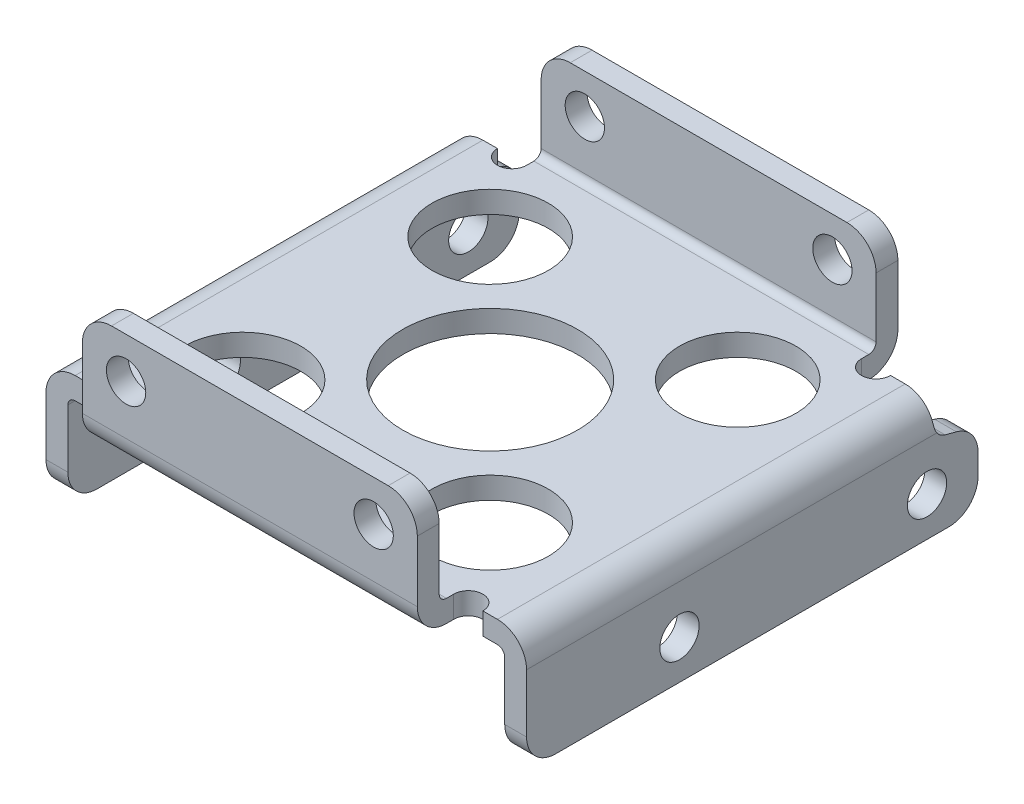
ISO-10303-21;
HEADER;
FILE_DESCRIPTION(('STEP AP214'),'2;1');
FILE_NAME('part.step','',(''),(''),'','','');
FILE_SCHEMA(('AUTOMOTIVE_DESIGN { 1 0 10303 214 1 1 1 1 }'));
ENDSEC;
DATA;
#1=APPLICATION_CONTEXT('core data for automotive mechanical design processes');
#2=APPLICATION_PROTOCOL_DEFINITION('international standard','automotive_design',2000,#1);
#3=PRODUCT_CONTEXT('',#1,'mechanical');
#4=PRODUCT('Part','Part','',(#3));
#5=PRODUCT_RELATED_PRODUCT_CATEGORY('part','',(#4));
#6=PRODUCT_DEFINITION_FORMATION('','',#4);
#7=PRODUCT_DEFINITION_CONTEXT('part definition',#1,'design');
#8=PRODUCT_DEFINITION('design','',#6,#7);
#9=PRODUCT_DEFINITION_SHAPE('','',#8);
#10=(LENGTH_UNIT() NAMED_UNIT(*) SI_UNIT(.MILLI.,.METRE.));
#11=(NAMED_UNIT(*) PLANE_ANGLE_UNIT() SI_UNIT($,.RADIAN.));
#12=(NAMED_UNIT(*) SI_UNIT($,.STERADIAN.) SOLID_ANGLE_UNIT());
#13=UNCERTAINTY_MEASURE_WITH_UNIT(LENGTH_MEASURE(1.E-05),#10,'distance_accuracy_value','');
#14=(GEOMETRIC_REPRESENTATION_CONTEXT(3) GLOBAL_UNCERTAINTY_ASSIGNED_CONTEXT((#13)) GLOBAL_UNIT_ASSIGNED_CONTEXT((#10,
#11,#12)) REPRESENTATION_CONTEXT('',''));
#15=CARTESIAN_POINT('',(0.,0.,0.));
#16=DIRECTION('',(0.,0.,1.));
#17=DIRECTION('',(1.,0.,0.));
#18=AXIS2_PLACEMENT_3D('',#15,#16,#17);
#19=CARTESIAN_POINT('',(95.1801243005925,13.067326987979,-10.));
#20=DIRECTION('',(1.,0.,0.));
#21=DIRECTION('',(0.,0.,-1.));
#22=AXIS2_PLACEMENT_3D('',#19,#20,#21);
#23=CYLINDRICAL_SURFACE('',#22,1.00000000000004);
#24=DIRECTION('',(-1.,0.,0.));
#25=VECTOR('',#24,1.);
#26=CARTESIAN_POINT('',(96.5,13.0673269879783,-9.));
#27=LINE('',#26,#25);
#28=CARTESIAN_POINT('',(98.4178477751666,13.0673269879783,-9.));
#29=VERTEX_POINT('',#28);
#30=CARTESIAN_POINT('',(96.5,13.0673269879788,-9.));
#31=VERTEX_POINT('',#30);
#32=EDGE_CURVE('E322',#29,#31,#27,.T.);
#33=ORIENTED_EDGE('',*,*,#32,.F.);
#34=CARTESIAN_POINT('',(98.5,12.5,-9.17650738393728));
#35=CARTESIAN_POINT('',(98.5000001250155,12.5107884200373,-9.16907419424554));
#36=CARTESIAN_POINT('',(98.4999127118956,12.5217232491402,-9.16185290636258));
#37=CARTESIAN_POINT('',(98.4995501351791,12.5438277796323,-9.14787413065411));
#38=CARTESIAN_POINT('',(98.4992756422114,12.554996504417,-9.14111508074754));
#39=CARTESIAN_POINT('',(98.4985271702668,12.5775654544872,-9.1280606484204));
#40=CARTESIAN_POINT('',(98.4980535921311,12.5889651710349,-9.12176436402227));
#41=CARTESIAN_POINT('',(98.496895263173,12.6119916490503,-9.10963465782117));
#42=CARTESIAN_POINT('',(98.4962106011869,12.6236183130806,-9.10380104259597));
#43=CARTESIAN_POINT('',(98.4946182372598,12.6470940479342,-9.09259598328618));
#44=CARTESIAN_POINT('',(98.4937102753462,12.6589433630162,-9.08722508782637));
#45=CARTESIAN_POINT('',(98.4916593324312,12.6828593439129,-9.07694473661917));
#46=CARTESIAN_POINT('',(98.4905157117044,12.6949265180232,-9.07203659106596));
#47=CARTESIAN_POINT('',(98.4879813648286,12.7192727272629,-9.06268087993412));
#48=CARTESIAN_POINT('',(98.4865895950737,12.7315524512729,-9.05823539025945));
#49=CARTESIAN_POINT('',(98.4835467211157,12.7563180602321,-9.04980459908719));
#50=CARTESIAN_POINT('',(98.4818941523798,12.7688047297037,-9.0458221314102));
#51=CARTESIAN_POINT('',(98.4784441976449,12.7930856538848,-9.03858115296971));
#52=CARTESIAN_POINT('',(98.4766627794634,12.8048732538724,-9.03529266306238));
#53=CARTESIAN_POINT('',(98.4728743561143,12.8284958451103,-9.02915502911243));
#54=CARTESIAN_POINT('',(98.4708678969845,12.8403306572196,-9.0263048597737));
#55=CARTESIAN_POINT('',(98.4666259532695,12.8640429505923,-9.02104372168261));
#56=CARTESIAN_POINT('',(98.4643907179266,12.8759203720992,-9.01863228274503));
#57=CARTESIAN_POINT('',(98.4596878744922,12.8997130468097,-9.01424793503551));
#58=CARTESIAN_POINT('',(98.4572202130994,12.9116283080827,-9.0122751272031));
#59=CARTESIAN_POINT('',(98.4520492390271,12.9354917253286,-9.00876750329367));
#60=CARTESIAN_POINT('',(98.449345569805,12.9474399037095,-9.00723336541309));
#61=CARTESIAN_POINT('',(98.4436993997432,12.9713641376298,-9.00460246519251));
#62=CARTESIAN_POINT('',(98.4407562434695,12.9833401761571,-9.00350695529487));
#63=CARTESIAN_POINT('',(98.4346279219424,13.007314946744,-9.0017528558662));
#64=CARTESIAN_POINT('',(98.431441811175,13.0193135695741,-9.00109608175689));
#65=CARTESIAN_POINT('',(98.4248247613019,13.0433284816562,-9.00021846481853));
#66=CARTESIAN_POINT('',(98.4213926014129,13.055344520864,-8.9999999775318));
#67=CARTESIAN_POINT('',(98.4178477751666,13.0673269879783,-9.));
#68=B_SPLINE_CURVE_WITH_KNOTS('',3,(#34,#35,#36,#37,#38,#39,#40,#41,#42,#43,#44,#45,#46,#47,#48,
#49,#50,#51,#52,#53,#54,#55,#56,#57,#58,#59,#60,#61,#62,#63,#64,#65,#66,#67),.UNSPECIFIED.,.F.,
.F.,(4,2,2,2,2,2,2,2,2,2,2,2,2,2,2,2,4),(0.,0.0393013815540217,0.0784626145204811,
0.117545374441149,0.156611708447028,0.195723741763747,0.234943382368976,0.274332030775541,
0.313950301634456,0.351040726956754,0.388043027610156,0.42500543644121,0.461976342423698,
0.499004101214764,0.53613684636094,0.573422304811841,0.610907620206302),.UNSPECIFIED.);
#69=CARTESIAN_POINT('',(98.5,12.4999999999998,-9.17650738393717));
#70=VERTEX_POINT('',#69);
#71=EDGE_CURVE('E1052',#70,#29,#68,.T.);
#72=ORIENTED_EDGE('',*,*,#71,.F.);
#73=CARTESIAN_POINT('',(98.5,12.1014011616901,-9.74118095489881));
#74=CARTESIAN_POINT('',(98.5,12.147860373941,-9.56914953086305));
#75=CARTESIAN_POINT('',(98.5,12.2503630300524,-9.42331126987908));
#76=CARTESIAN_POINT('',(98.5,12.3517336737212,-9.27908360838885));
#77=CARTESIAN_POINT('',(98.5,12.4999999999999,-9.17650738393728));
#78=B_SPLINE_CURVE_WITH_KNOTS('',2,(#73,#74,#75,#76,#77),.UNSPECIFIED.,.F.,.F.,(3,2,3),(0.,0.5,
1.),.UNSPECIFIED.);
#79=CARTESIAN_POINT('',(98.5,12.1014011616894,-9.74118095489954));
#80=VERTEX_POINT('',#79);
#81=EDGE_CURVE('E349',#80,#70,#78,.T.);
#82=ORIENTED_EDGE('',*,*,#81,.F.);
#83=DIRECTION('',(1.,0.,0.));
#84=VECTOR('',#83,1.);
#85=CARTESIAN_POINT('',(95.1801243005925,12.1014011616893,-9.74118095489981));
#86=LINE('',#85,#84);
#87=CARTESIAN_POINT('',(97.,12.1014011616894,-9.74118095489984));
#88=VERTEX_POINT('',#87);
#89=EDGE_CURVE('E1010',#88,#80,#86,.T.);
#90=ORIENTED_EDGE('',*,*,#89,.F.);
#91=CARTESIAN_POINT('',(97.,12.4999999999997,-9.17650738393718));
#92=CARTESIAN_POINT('',(97.,12.3549363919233,-9.27689344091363));
#93=CARTESIAN_POINT('',(97.,12.2508864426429,-9.42368074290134));
#94=CARTESIAN_POINT('',(97.,12.1479509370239,-9.56889585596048));
#95=CARTESIAN_POINT('',(97.,12.1014011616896,-9.74118095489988));
#96=B_SPLINE_CURVE_WITH_KNOTS('',2,(#91,#92,#93,#94,#95),.UNSPECIFIED.,.F.,.F.,(3,2,3),(0.,0.5,
1.),.UNSPECIFIED.);
#97=CARTESIAN_POINT('',(97.,12.4999999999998,-9.17650738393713));
#98=VERTEX_POINT('',#97);
#99=EDGE_CURVE('E1070',#98,#88,#96,.T.);
#100=ORIENTED_EDGE('',*,*,#99,.F.);
#101=CARTESIAN_POINT('',(96.5,13.,-9.00226903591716));
#102=CARTESIAN_POINT('',(96.5055707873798,13.000000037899,-9.00226906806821));
#103=CARTESIAN_POINT('',(96.5111415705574,12.9999069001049,-9.00227656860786));
#104=CARTESIAN_POINT('',(96.5221919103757,12.9995373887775,-9.00230701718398));
#105=CARTESIAN_POINT('',(96.5276715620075,12.9992638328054,-9.0023297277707));
#106=CARTESIAN_POINT('',(96.538534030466,12.9985421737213,-9.00239059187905));
#107=CARTESIAN_POINT('',(96.5439170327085,12.9980968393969,-9.00242850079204));
#108=CARTESIAN_POINT('',(96.5545811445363,12.9970403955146,-9.00251977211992));
#109=CARTESIAN_POINT('',(96.559862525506,12.9964320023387,-9.00257288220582));
#110=CARTESIAN_POINT('',(96.5703188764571,12.9950581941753,-9.00269456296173));
#111=CARTESIAN_POINT('',(96.575494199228,12.9942954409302,-9.00276287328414));
#112=CARTESIAN_POINT('',(96.5857344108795,12.9926216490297,-9.00291496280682));
#113=CARTESIAN_POINT('',(96.5907997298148,12.9917132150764,-9.00299847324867));
#114=CARTESIAN_POINT('',(96.6008164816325,12.989756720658,-9.00318097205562));
#115=CARTESIAN_POINT('',(96.6057684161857,12.9887112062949,-9.00327968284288));
#116=CARTESIAN_POINT('',(96.6155551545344,12.98648922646,-9.00349258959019));
#117=CARTESIAN_POINT('',(96.6203905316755,12.9853152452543,-9.00360649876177));
#118=CARTESIAN_POINT('',(96.634594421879,12.9816412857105,-9.00396832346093));
#119=CARTESIAN_POINT('',(96.6439111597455,12.9789400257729,-9.00424084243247));
#120=CARTESIAN_POINT('',(96.6620472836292,12.9731049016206,-9.00484912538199));
#121=CARTESIAN_POINT('',(96.6708726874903,12.9699893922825,-9.00518235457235));
#122=CARTESIAN_POINT('',(96.6880174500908,12.9633904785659,-9.00591226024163));
#123=CARTESIAN_POINT('',(96.696343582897,12.959924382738,-9.00630621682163));
#124=CARTESIAN_POINT('',(96.7124857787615,12.9526865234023,-9.00715776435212));
#125=CARTESIAN_POINT('',(96.7203092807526,12.9489309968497,-9.00761243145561));
#126=CARTESIAN_POINT('',(96.7354475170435,12.9411734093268,-9.00858561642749));
#127=CARTESIAN_POINT('',(96.7427702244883,12.9371865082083,-9.00910098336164));
#128=CARTESIAN_POINT('',(96.7569125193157,12.9290220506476,-9.01019580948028));
#129=CARTESIAN_POINT('',(96.7637405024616,12.9248585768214,-9.01077186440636));
#130=CARTESIAN_POINT('',(96.776902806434,12.9163934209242,-9.01198832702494));
#131=CARTESIAN_POINT('',(96.7832458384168,12.9121047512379,-9.01262504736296));
#132=CARTESIAN_POINT('',(96.795450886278,12.9034381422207,-9.01396316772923));
#133=CARTESIAN_POINT('',(96.8013218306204,12.8990721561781,-9.01466056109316));
#134=CARTESIAN_POINT('',(96.812598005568,12.8902962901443,-9.0161202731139));
#135=CARTESIAN_POINT('',(96.8180122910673,12.8858973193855,-9.0168782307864));
#136=CARTESIAN_POINT('',(96.8283925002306,12.877097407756,-9.0184597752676));
#137=CARTESIAN_POINT('',(96.8333675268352,12.872706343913,-9.01927858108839));
#138=CARTESIAN_POINT('',(96.8428884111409,12.863960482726,-9.02098113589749));
#139=CARTESIAN_POINT('',(96.847443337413,12.8596145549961,-9.0218596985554));
#140=CARTESIAN_POINT('',(96.8561436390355,12.8509946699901,-9.023686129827));
#141=CARTESIAN_POINT('',(96.8602980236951,12.8467285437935,-9.0246280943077));
#142=CARTESIAN_POINT('',(96.8703165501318,12.8360670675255,-9.02708201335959));
#143=CARTESIAN_POINT('',(96.8760860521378,12.8295967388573,-9.02865655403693));
#144=CARTESIAN_POINT('',(96.8872130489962,12.8164485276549,-9.03201265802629));
#145=CARTESIAN_POINT('',(96.892573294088,12.8097725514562,-9.0337925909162));
#146=CARTESIAN_POINT('',(96.9028804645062,12.7962417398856,-9.0375647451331));
#147=CARTESIAN_POINT('',(96.9078299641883,12.7893884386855,-9.03955543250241));
#148=CARTESIAN_POINT('',(96.9173164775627,12.77553045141,-9.04374752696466));
#149=CARTESIAN_POINT('',(96.9218558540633,12.7685269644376,-9.04594755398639));
#150=CARTESIAN_POINT('',(96.9305245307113,12.7543952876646,-9.05055855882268));
#151=CARTESIAN_POINT('',(96.9346559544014,12.7472679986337,-9.05296830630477));
#152=CARTESIAN_POINT('',(96.942512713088,12.7329143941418,-9.057998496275));
#153=CARTESIAN_POINT('',(96.9462399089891,12.7256887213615,-9.06061786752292));
#154=CARTESIAN_POINT('',(96.9532936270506,12.7111629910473,-9.06606717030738));
#155=CARTESIAN_POINT('',(96.9566217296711,12.7038633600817,-9.0688961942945));
#156=CARTESIAN_POINT('',(96.9628839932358,12.6892132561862,-9.07476462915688));
#157=CARTESIAN_POINT('',(96.9658194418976,12.6818630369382,-9.07780330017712));
#158=CARTESIAN_POINT('',(96.9713043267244,12.6671341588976,-9.08409086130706));
#159=CARTESIAN_POINT('',(96.9738547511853,12.6597556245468,-9.08733918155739));
#160=CARTESIAN_POINT('',(96.9785785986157,12.6449913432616,-9.09404586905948));
#161=CARTESIAN_POINT('',(96.9807527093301,12.6376056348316,-9.09750383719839));
#162=CARTESIAN_POINT('',(96.9847339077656,12.6228470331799,-9.10462964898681));
#163=CARTESIAN_POINT('',(96.9865413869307,12.6154741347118,-9.10829726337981));
#164=CARTESIAN_POINT('',(96.9898001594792,12.60075996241,-9.11584219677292));
#165=CARTESIAN_POINT('',(96.9912515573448,12.593418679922,-9.11971945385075));
#166=CARTESIAN_POINT('',(96.993809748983,12.5787853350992,-9.12768350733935));
#167=CARTESIAN_POINT('',(96.994916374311,12.571493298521,-9.13177040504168));
#168=CARTESIAN_POINT('',(96.9967972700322,12.5569747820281,-9.14015356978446));
#169=CARTESIAN_POINT('',(96.9975711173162,12.5497483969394,-9.14445009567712));
#170=CARTESIAN_POINT('',(96.9987991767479,12.5353764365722,-9.153252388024));
#171=CARTESIAN_POINT('',(96.9992527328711,12.5282310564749,-9.15775856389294));
#172=CARTESIAN_POINT('',(96.9998536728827,12.5140346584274,-9.16697990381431));
#173=CARTESIAN_POINT('',(97.000000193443,12.5069839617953,-9.17169561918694));
#174=CARTESIAN_POINT('',(97.,12.5,-9.17650738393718));
#175=B_SPLINE_CURVE_WITH_KNOTS('',3,(#101,#102,#103,#104,#105,#106,#107,#108,#109,#110,#111,
#112,#113,#114,#115,#116,#117,#118,#119,#120,#121,#122,#123,#124,#125,#126,#127,#128,#129,#130,
#131,#132,#133,#134,#135,#136,#137,#138,#139,#140,#141,#142,#143,#144,#145,#146,#147,#148,#149,
#150,#151,#152,#153,#154,#155,#156,#157,#158,#159,#160,#161,#162,#163,#164,#165,#166,#167,#168,
#169,#170,#171,#172,#173,#174),.UNSPECIFIED.,.F.,.F.,(4,2,2,2,2,2,2,2,2,2,2,2,2,2,2,2,2,2,2,2,2,
2,2,2,2,2,2,2,2,2,2,2,2,2,2,2,4),(0.,0.0167115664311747,0.0331681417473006,0.0493698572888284,
0.0653168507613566,0.0810092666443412,0.0964472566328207,0.111630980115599,0.126560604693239,
0.155655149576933,0.183735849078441,0.210804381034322,0.236862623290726,0.261912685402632,
0.285956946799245,0.308998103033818,0.331039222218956,0.352083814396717,0.372135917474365,
0.391200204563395,0.409282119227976,0.435699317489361,0.46191962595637,0.487960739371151,
0.513840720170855,0.539577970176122,0.565191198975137,0.590699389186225,0.616121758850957,
0.641477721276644,0.666786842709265,0.692068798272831,0.717343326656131,0.742630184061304,
0.767949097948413,0.793319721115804,0.818761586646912),.UNSPECIFIED.);
#176=CARTESIAN_POINT('',(96.5,13.,-9.00226903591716));
#177=VERTEX_POINT('',#176);
#178=EDGE_CURVE('E649',#177,#98,#175,.T.);
#179=ORIENTED_EDGE('',*,*,#178,.F.);
#180=CARTESIAN_POINT('',(95.4999540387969,13.,-9.002252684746));
#181=DIRECTION('',(0.999999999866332,0.,-1.63504196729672E-05));
#182=VECTOR('',#181,1.);
#183=LINE('',#180,#182);
#184=CARTESIAN_POINT('',(95.4999556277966,13.0001618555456,-9.00118822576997));
#185=VERTEX_POINT('',#184);
#186=EDGE_CURVE('E1057',#185,#177,#183,.T.);
#187=ORIENTED_EDGE('',*,*,#186,.F.);
#188=CARTESIAN_POINT('',(96.5,13.0673269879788,-9.));
#189=CARTESIAN_POINT('',(95.6645424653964,13.0675486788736,-9.));
#190=CARTESIAN_POINT('',(95.4999540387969,13.0001722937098,-9.));
#191=B_SPLINE_CURVE_WITH_KNOTS('',2,(#188,#189,#190),.UNSPECIFIED.,.F.,.F.,(3,3),(0.,1.),.UNSPECIFIED.);
#192=EDGE_CURVE('E332',#31,#185,#191,.T.);
#193=ORIENTED_EDGE('',*,*,#192,.F.);
#194=EDGE_LOOP('',(#33,#72,#82,#90,#100,#179,#187,#193));
#195=FACE_BOUND('',#194,.T.);
#196=ADVANCED_FACE('F17',(#195),#23,.F.);
#197=CARTESIAN_POINT('',(96.5,12.9912427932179,-9.));
#198=DIRECTION('',(0.,0.,-1.));
#199=DIRECTION('',(-1.,0.,0.));
#200=AXIS2_PLACEMENT_3D('',#197,#198,#199);
#201=PLANE('',#200);
#202=ORIENTED_EDGE('',*,*,#192,.T.);
#203=DIRECTION('',(0.,-1.,0.));
#204=VECTOR('',#203,1.);
#205=CARTESIAN_POINT('',(95.5,13.0001618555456,-9.));
#206=LINE('',#205,#204);
#207=CARTESIAN_POINT('',(95.5,14.5,-9.));
#208=VERTEX_POINT('',#207);
#209=EDGE_CURVE('E316',#185,#208,#206,.F.);
#210=ORIENTED_EDGE('',*,*,#209,.T.);
#211=DIRECTION('',(-1.,0.,0.));
#212=VECTOR('',#211,1.);
#213=CARTESIAN_POINT('',(96.5,14.5,-9.));
#214=LINE('',#213,#212);
#215=CARTESIAN_POINT('',(96.5,14.5,-9.));
#216=VERTEX_POINT('',#215);
#217=EDGE_CURVE('E327',#208,#216,#214,.F.);
#218=ORIENTED_EDGE('',*,*,#217,.T.);
#219=CARTESIAN_POINT('',(96.5,12.5,-9.));
#220=DIRECTION('',(0.,0.,1.));
#221=DIRECTION('',(1.,0.,0.));
#222=AXIS2_PLACEMENT_3D('',#219,#220,#221);
#223=CIRCLE('',#222,2.);
#224=EDGE_CURVE('E912',#29,#216,#223,.T.);
#225=ORIENTED_EDGE('',*,*,#224,.F.);
#226=ORIENTED_EDGE('',*,*,#32,.T.);
#227=EDGE_LOOP('',(#202,#210,#218,#225,#226));
#228=FACE_BOUND('',#227,.T.);
#229=ADVANCED_FACE('F365',(#228),#201,.T.);
#230=CARTESIAN_POINT('',(98.5,6.5,19.));
#231=DIRECTION('',(1.,0.,0.));
#232=DIRECTION('',(0.,0.,-1.));
#233=AXIS2_PLACEMENT_3D('',#230,#231,#232);
#234=PLANE('',#233);
#235=CARTESIAN_POINT('',(98.5,9.2,-8.5));
#236=DIRECTION('',(1.,0.,0.));
#237=DIRECTION('',(0.,0.,-1.));
#238=AXIS2_PLACEMENT_3D('',#235,#236,#237);
#239=CIRCLE('',#238,1.35);
#240=CARTESIAN_POINT('',(98.5,9.2,-9.85));
#241=VERTEX_POINT('',#240);
#242=EDGE_CURVE('E997',#241,#241,#239,.F.);
#243=ORIENTED_EDGE('',*,*,#242,.T.);
#244=EDGE_LOOP('',(#243));
#245=FACE_BOUND('',#244,.T.);
#246=CARTESIAN_POINT('',(98.5,9.2,8.5));
#247=DIRECTION('',(1.,0.,0.));
#248=DIRECTION('',(0.,0.,-1.));
#249=AXIS2_PLACEMENT_3D('',#246,#247,#248);
#250=CIRCLE('',#249,1.35);
#251=CARTESIAN_POINT('',(98.5,9.2,7.15));
#252=VERTEX_POINT('',#251);
#253=EDGE_CURVE('E319',#252,#252,#250,.F.);
#254=ORIENTED_EDGE('',*,*,#253,.T.);
#255=EDGE_LOOP('',(#254));
#256=FACE_BOUND('',#255,.T.);
#257=CARTESIAN_POINT('',(98.5,9.96149844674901,-10.0000000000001));
#258=DIRECTION('',(-1.,0.,0.));
#259=DIRECTION('',(0.,0.,1.));
#260=AXIS2_PLACEMENT_3D('',#257,#258,#259);
#261=CIRCLE('',#260,1.99999999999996);
#262=CARTESIAN_POINT('',(98.5,11.8933500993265,-10.5176380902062));
#263=VERTEX_POINT('',#262);
#264=CARTESIAN_POINT('',(98.5,9.96149844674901,-12.));
#265=VERTEX_POINT('',#264);
#266=EDGE_CURVE('E972',#263,#265,#261,.T.);
#267=ORIENTED_EDGE('',*,*,#266,.F.);
#268=DIRECTION('',(0.,0.258819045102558,0.965925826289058));
#269=VECTOR('',#268,1.);
#270=CARTESIAN_POINT('',(98.5,12.101401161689,-9.74118095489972));
#271=LINE('',#270,#269);
#272=EDGE_CURVE('E973',#80,#263,#271,.F.);
#273=ORIENTED_EDGE('',*,*,#272,.F.);
#274=ORIENTED_EDGE('',*,*,#81,.T.);
#275=DIRECTION('',(0.,0.,1.));
#276=VECTOR('',#275,1.);
#277=CARTESIAN_POINT('',(98.5,12.5,-9.34556642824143));
#278=LINE('',#277,#276);
#279=CARTESIAN_POINT('',(98.5,12.5,19.));
#280=VERTEX_POINT('',#279);
#281=EDGE_CURVE('E1082',#280,#70,#278,.F.);
#282=ORIENTED_EDGE('',*,*,#281,.F.);
#283=DIRECTION('',(0.,1.,0.));
#284=VECTOR('',#283,1.);
#285=CARTESIAN_POINT('',(98.5,14.5,19.));
#286=LINE('',#285,#284);
#287=CARTESIAN_POINT('',(98.5,8.50000000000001,19.));
#288=VERTEX_POINT('',#287);
#289=EDGE_CURVE('E947',#288,#280,#286,.T.);
#290=ORIENTED_EDGE('',*,*,#289,.F.);
#291=CARTESIAN_POINT('',(98.5,8.5,17.));
#292=DIRECTION('',(-1.,0.,0.));
#293=DIRECTION('',(0.,0.,1.));
#294=AXIS2_PLACEMENT_3D('',#291,#292,#293);
#295=CIRCLE('',#294,2.);
#296=CARTESIAN_POINT('',(98.5,6.5,17.));
#297=VERTEX_POINT('',#296);
#298=EDGE_CURVE('E956',#297,#288,#295,.T.);
#299=ORIENTED_EDGE('',*,*,#298,.F.);
#300=DIRECTION('',(0.,0.,-1.));
#301=VECTOR('',#300,1.);
#302=CARTESIAN_POINT('',(98.5,6.5,-10.));
#303=LINE('',#302,#301);
#304=CARTESIAN_POINT('',(98.5,6.5,-10.));
#305=VERTEX_POINT('',#304);
#306=EDGE_CURVE('E957',#305,#297,#303,.F.);
#307=ORIENTED_EDGE('',*,*,#306,.F.);
#308=CARTESIAN_POINT('',(98.5,8.49999999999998,-10.));
#309=DIRECTION('',(1.,0.,0.));
#310=DIRECTION('',(0.,0.,-1.));
#311=AXIS2_PLACEMENT_3D('',#308,#309,#310);
#312=CIRCLE('',#311,2.);
#313=CARTESIAN_POINT('',(98.5,8.49999999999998,-12.));
#314=VERTEX_POINT('',#313);
#315=EDGE_CURVE('E961',#314,#305,#312,.F.);
#316=ORIENTED_EDGE('',*,*,#315,.F.);
#317=DIRECTION('',(0.,1.,0.));
#318=VECTOR('',#317,1.);
#319=CARTESIAN_POINT('',(98.5,9.961498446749,-12.));
#320=LINE('',#319,#318);
#321=EDGE_CURVE('E968',#265,#314,#320,.F.);
#322=ORIENTED_EDGE('',*,*,#321,.F.);
#323=EDGE_LOOP('',(#267,#273,#274,#282,#290,#299,#307,#316,#322));
#324=FACE_BOUND('',#323,.T.);
#325=ADVANCED_FACE('F355',(#245,#256,#324),#234,.T.);
#326=CARTESIAN_POINT('',(65.5,12.5,19.));
#327=DIRECTION('',(-1.,0.,0.));
#328=DIRECTION('',(0.,0.,1.));
#329=AXIS2_PLACEMENT_3D('',#326,#327,#328);
#330=PLANE('',#329);
#331=CARTESIAN_POINT('',(65.5,9.2,-8.5));
#332=DIRECTION('',(1.,0.,0.));
#333=DIRECTION('',(0.,0.,-1.));
#334=AXIS2_PLACEMENT_3D('',#331,#332,#333);
#335=CIRCLE('',#334,1.35);
#336=CARTESIAN_POINT('',(65.5,9.2,-9.85));
#337=VERTEX_POINT('',#336);
#338=EDGE_CURVE('E1100',#337,#337,#335,.T.);
#339=ORIENTED_EDGE('',*,*,#338,.T.);
#340=EDGE_LOOP('',(#339));
#341=FACE_BOUND('',#340,.T.);
#342=CARTESIAN_POINT('',(65.5,9.2,8.5));
#343=DIRECTION('',(1.,0.,0.));
#344=DIRECTION('',(0.,0.,-1.));
#345=AXIS2_PLACEMENT_3D('',#342,#343,#344);
#346=CIRCLE('',#345,1.35);
#347=CARTESIAN_POINT('',(65.5,9.2,7.15));
#348=VERTEX_POINT('',#347);
#349=EDGE_CURVE('E1104',#348,#348,#346,.T.);
#350=ORIENTED_EDGE('',*,*,#349,.T.);
#351=EDGE_LOOP('',(#350));
#352=FACE_BOUND('',#351,.T.);
#353=DIRECTION('',(0.,1.,0.));
#354=VECTOR('',#353,1.);
#355=CARTESIAN_POINT('',(65.5,14.5,19.));
#356=LINE('',#355,#354);
#357=CARTESIAN_POINT('',(65.5,12.4999999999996,19.));
#358=VERTEX_POINT('',#357);
#359=CARTESIAN_POINT('',(65.5,8.5,19.));
#360=VERTEX_POINT('',#359);
#361=EDGE_CURVE('E1099',#358,#360,#356,.F.);
#362=ORIENTED_EDGE('',*,*,#361,.F.);
#363=DIRECTION('',(0.,0.,1.));
#364=VECTOR('',#363,1.);
#365=CARTESIAN_POINT('',(65.5,12.4999999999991,-9.34556642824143));
#366=LINE('',#365,#364);
#367=CARTESIAN_POINT('',(65.5,12.4999999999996,-9.17650738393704));
#368=VERTEX_POINT('',#367);
#369=EDGE_CURVE('E487',#368,#358,#366,.T.);
#370=ORIENTED_EDGE('',*,*,#369,.F.);
#371=CARTESIAN_POINT('',(65.5,13.067326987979,-9.99999999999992));
#372=DIRECTION('',(-1.,0.,0.));
#373=DIRECTION('',(0.,0.,1.));
#374=AXIS2_PLACEMENT_3D('',#371,#372,#373);
#375=CIRCLE('',#374,0.999999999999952);
#376=CARTESIAN_POINT('',(65.5,12.1014011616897,-9.74118095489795));
#377=VERTEX_POINT('',#376);
#378=EDGE_CURVE('E913',#368,#377,#375,.F.);
#379=ORIENTED_EDGE('',*,*,#378,.T.);
#380=DIRECTION('',(0.,0.258819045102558,0.965925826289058));
#381=VECTOR('',#380,1.);
#382=CARTESIAN_POINT('',(65.5,12.101401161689,-9.74118095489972));
#383=LINE('',#382,#381);
#384=CARTESIAN_POINT('',(65.5,11.8933500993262,-10.5176380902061));
#385=VERTEX_POINT('',#384);
#386=EDGE_CURVE('E917',#385,#377,#383,.T.);
#387=ORIENTED_EDGE('',*,*,#386,.F.);
#388=CARTESIAN_POINT('',(65.5,9.961498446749,-10.0000000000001));
#389=DIRECTION('',(1.,0.,0.));
#390=DIRECTION('',(0.,0.,-1.));
#391=AXIS2_PLACEMENT_3D('',#388,#389,#390);
#392=CIRCLE('',#391,1.99999999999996);
#393=CARTESIAN_POINT('',(65.5,9.961498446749,-12.));
#394=VERTEX_POINT('',#393);
#395=EDGE_CURVE('E918',#394,#385,#392,.T.);
#396=ORIENTED_EDGE('',*,*,#395,.F.);
#397=DIRECTION('',(0.,1.,0.));
#398=VECTOR('',#397,1.);
#399=CARTESIAN_POINT('',(65.5,9.961498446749,-12.));
#400=LINE('',#399,#398);
#401=CARTESIAN_POINT('',(65.5,8.5,-12.));
#402=VERTEX_POINT('',#401);
#403=EDGE_CURVE('E922',#402,#394,#400,.T.);
#404=ORIENTED_EDGE('',*,*,#403,.F.);
#405=CARTESIAN_POINT('',(65.5,8.5,-10.));
#406=DIRECTION('',(1.,0.,0.));
#407=DIRECTION('',(0.,0.,-1.));
#408=AXIS2_PLACEMENT_3D('',#405,#406,#407);
#409=CIRCLE('',#408,2.);
#410=CARTESIAN_POINT('',(65.5,6.5,-10.));
#411=VERTEX_POINT('',#410);
#412=EDGE_CURVE('E926',#411,#402,#409,.T.);
#413=ORIENTED_EDGE('',*,*,#412,.F.);
#414=DIRECTION('',(0.,0.,-1.));
#415=VECTOR('',#414,1.);
#416=CARTESIAN_POINT('',(65.5,6.5,-10.));
#417=LINE('',#416,#415);
#418=CARTESIAN_POINT('',(65.5,6.5,17.));
#419=VERTEX_POINT('',#418);
#420=EDGE_CURVE('E930',#419,#411,#417,.T.);
#421=ORIENTED_EDGE('',*,*,#420,.F.);
#422=CARTESIAN_POINT('',(65.5,8.5,17.));
#423=DIRECTION('',(1.,0.,0.));
#424=DIRECTION('',(0.,0.,-1.));
#425=AXIS2_PLACEMENT_3D('',#422,#423,#424);
#426=CIRCLE('',#425,2.);
#427=EDGE_CURVE('E934',#360,#419,#426,.T.);
#428=ORIENTED_EDGE('',*,*,#427,.F.);
#429=EDGE_LOOP('',(#362,#370,#379,#387,#396,#404,#413,#421,#428));
#430=FACE_BOUND('',#429,.T.);
#431=ADVANCED_FACE('F364',(#341,#352,#430),#330,.T.);
#432=CARTESIAN_POINT('',(68.5,13.,-9.));
#433=DIRECTION('',(0.,0.,-1.));
#434=DIRECTION('',(-1.,0.,0.));
#435=AXIS2_PLACEMENT_3D('',#432,#433,#434);
#436=PLANE('',#435);
#437=DIRECTION('',(-1.,0.,0.));
#438=VECTOR('',#437,1.);
#439=CARTESIAN_POINT('',(68.5,14.5,-9.));
#440=LINE('',#439,#438);
#441=CARTESIAN_POINT('',(67.5,14.5,-9.));
#442=VERTEX_POINT('',#441);
#443=CARTESIAN_POINT('',(68.5,14.5,-9.));
#444=VERTEX_POINT('',#443);
#445=EDGE_CURVE('E296',#442,#444,#440,.F.);
#446=ORIENTED_EDGE('',*,*,#445,.T.);
#447=DIRECTION('',(0.,1.,0.));
#448=VECTOR('',#447,1.);
#449=CARTESIAN_POINT('',(68.5,13.,-9.));
#450=LINE('',#449,#448);
#451=CARTESIAN_POINT('',(68.5,13.,-9.));
#452=VERTEX_POINT('',#451);
#453=EDGE_CURVE('E1000',#444,#452,#450,.F.);
#454=ORIENTED_EDGE('',*,*,#453,.T.);
#455=DIRECTION('',(-1.,0.,0.));
#456=VECTOR('',#455,1.);
#457=CARTESIAN_POINT('',(68.5,13.,-9.));
#458=LINE('',#457,#456);
#459=CARTESIAN_POINT('',(67.5,13.,-9.));
#460=VERTEX_POINT('',#459);
#461=EDGE_CURVE('E314',#452,#460,#458,.T.);
#462=ORIENTED_EDGE('',*,*,#461,.T.);
#463=CARTESIAN_POINT('',(67.5,12.5,-9.));
#464=DIRECTION('',(0.,0.,1.));
#465=DIRECTION('',(1.,0.,0.));
#466=AXIS2_PLACEMENT_3D('',#463,#464,#465);
#467=CIRCLE('',#466,0.499999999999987);
#468=CARTESIAN_POINT('',(67.,12.5,-9.));
#469=VERTEX_POINT('',#468);
#470=EDGE_CURVE('E297',#460,#469,#467,.T.);
#471=ORIENTED_EDGE('',*,*,#470,.T.);
#472=DIRECTION('',(0.,1.,0.));
#473=VECTOR('',#472,1.);
#474=CARTESIAN_POINT('',(67.,13.,-9.));
#475=LINE('',#474,#473);
#476=CARTESIAN_POINT('',(67.,13.067326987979,-9.));
#477=VERTEX_POINT('',#476);
#478=EDGE_CURVE('E284',#469,#477,#475,.T.);
#479=ORIENTED_EDGE('',*,*,#478,.T.);
#480=DIRECTION('',(-1.,0.,0.));
#481=VECTOR('',#480,1.);
#482=CARTESIAN_POINT('',(68.5,13.067326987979,-9.));
#483=LINE('',#482,#481);
#484=CARTESIAN_POINT('',(65.5821522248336,13.067326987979,-8.99999999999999));
#485=VERTEX_POINT('',#484);
#486=EDGE_CURVE('E980',#477,#485,#483,.T.);
#487=ORIENTED_EDGE('',*,*,#486,.T.);
#488=CARTESIAN_POINT('',(67.5,12.5,-9.));
#489=DIRECTION('',(0.,0.,1.));
#490=DIRECTION('',(1.,0.,0.));
#491=AXIS2_PLACEMENT_3D('',#488,#489,#490);
#492=CIRCLE('',#491,1.99999999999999);
#493=EDGE_CURVE('E866',#442,#485,#492,.T.);
#494=ORIENTED_EDGE('',*,*,#493,.F.);
#495=EDGE_LOOP('',(#446,#454,#462,#471,#479,#487,#494));
#496=FACE_BOUND('',#495,.T.);
#497=ADVANCED_FACE('F311',(#496),#436,.T.);
#498=CARTESIAN_POINT('',(96.85,9.2,8.5));
#499=DIRECTION('',(1.,0.,0.));
#500=DIRECTION('',(0.,0.,-1.));
#501=AXIS2_PLACEMENT_3D('',#498,#499,#500);
#502=CYLINDRICAL_SURFACE('',#501,1.35);
#503=CARTESIAN_POINT('',(97.,9.2,8.5));
#504=DIRECTION('',(1.,0.,0.));
#505=DIRECTION('',(0.,0.,-1.));
#506=AXIS2_PLACEMENT_3D('',#503,#504,#505);
#507=CIRCLE('',#506,1.35);
#508=CARTESIAN_POINT('',(97.,9.2,7.15));
#509=VERTEX_POINT('',#508);
#510=EDGE_CURVE('E850',#509,#509,#507,.T.);
#511=ORIENTED_EDGE('',*,*,#510,.F.);
#512=EDGE_LOOP('',(#511));
#513=FACE_BOUND('',#512,.T.);
#514=ORIENTED_EDGE('',*,*,#253,.F.);
#515=EDGE_LOOP('',(#514));
#516=FACE_BOUND('',#515,.T.);
#517=ADVANCED_FACE('F374',(#513,#516),#502,.F.);
#518=CARTESIAN_POINT('',(96.85,9.2,-8.5));
#519=DIRECTION('',(1.,0.,0.));
#520=DIRECTION('',(0.,0.,-1.));
#521=AXIS2_PLACEMENT_3D('',#518,#519,#520);
#522=CYLINDRICAL_SURFACE('',#521,1.35);
#523=CARTESIAN_POINT('',(97.,9.2,-8.5));
#524=DIRECTION('',(1.,0.,0.));
#525=DIRECTION('',(0.,0.,-1.));
#526=AXIS2_PLACEMENT_3D('',#523,#524,#525);
#527=CIRCLE('',#526,1.35);
#528=CARTESIAN_POINT('',(97.,9.2,-9.85));
#529=VERTEX_POINT('',#528);
#530=EDGE_CURVE('E561',#529,#529,#527,.T.);
#531=ORIENTED_EDGE('',*,*,#530,.F.);
#532=EDGE_LOOP('',(#531));
#533=FACE_BOUND('',#532,.T.);
#534=ORIENTED_EDGE('',*,*,#242,.F.);
#535=EDGE_LOOP('',(#534));
#536=FACE_BOUND('',#535,.T.);
#537=ADVANCED_FACE('F377',(#533,#536),#522,.F.);
#538=CARTESIAN_POINT('',(97.,12.101401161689,-9.74118095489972));
#539=DIRECTION('',(0.,0.965925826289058,-0.258819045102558));
#540=DIRECTION('',(0.,0.258819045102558,0.965925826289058));
#541=AXIS2_PLACEMENT_3D('',#538,#539,#540);
#542=PLANE('',#541);
#543=DIRECTION('',(-1.,0.,0.));
#544=VECTOR('',#543,1.);
#545=CARTESIAN_POINT('',(98.65,11.8933500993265,-10.5176380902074));
#546=LINE('',#545,#544);
#547=CARTESIAN_POINT('',(97.,11.893350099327,-10.517638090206));
#548=VERTEX_POINT('',#547);
#549=EDGE_CURVE('E969',#548,#263,#546,.F.);
#550=ORIENTED_EDGE('',*,*,#549,.F.);
#551=DIRECTION('',(0.,-0.258819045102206,-0.965925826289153));
#552=VECTOR('',#551,1.);
#553=CARTESIAN_POINT('',(97.,12.1014011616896,-9.74118095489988));
#554=LINE('',#553,#552);
#555=EDGE_CURVE('E558',#88,#548,#554,.T.);
#556=ORIENTED_EDGE('',*,*,#555,.F.);
#557=ORIENTED_EDGE('',*,*,#89,.T.);
#558=ORIENTED_EDGE('',*,*,#272,.T.);
#559=EDGE_LOOP('',(#550,#556,#557,#558));
#560=FACE_BOUND('',#559,.T.);
#561=ADVANCED_FACE('F381',(#560),#542,.T.);
#562=CARTESIAN_POINT('',(98.6499999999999,9.961498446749,-10.0000000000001));
#563=DIRECTION('',(-1.,0.,0.));
#564=DIRECTION('',(0.,0.,1.));
#565=AXIS2_PLACEMENT_3D('',#562,#563,#564);
#566=CYLINDRICAL_SURFACE('',#565,1.99999999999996);
#567=ORIENTED_EDGE('',*,*,#549,.T.);
#568=ORIENTED_EDGE('',*,*,#266,.T.);
#569=DIRECTION('',(-1.,0.,0.));
#570=VECTOR('',#569,1.);
#571=CARTESIAN_POINT('',(98.5,9.96149844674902,-12.));
#572=LINE('',#571,#570);
#573=CARTESIAN_POINT('',(97.,9.96149844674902,-12.));
#574=VERTEX_POINT('',#573);
#575=EDGE_CURVE('E965',#574,#265,#572,.F.);
#576=ORIENTED_EDGE('',*,*,#575,.F.);
#577=CARTESIAN_POINT('',(97.,9.96149844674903,-10.0000000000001));
#578=DIRECTION('',(-1.,0.,0.));
#579=DIRECTION('',(0.,0.,1.));
#580=AXIS2_PLACEMENT_3D('',#577,#578,#579);
#581=CIRCLE('',#580,1.99999999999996);
#582=EDGE_CURVE('E557',#548,#574,#581,.T.);
#583=ORIENTED_EDGE('',*,*,#582,.F.);
#584=EDGE_LOOP('',(#567,#568,#576,#583));
#585=FACE_BOUND('',#584,.T.);
#586=ADVANCED_FACE('F385',(#585),#566,.T.);
#587=CARTESIAN_POINT('',(98.5,9.961498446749,-12.));
#588=DIRECTION('',(0.,0.,-1.));
#589=DIRECTION('',(-1.,0.,0.));
#590=AXIS2_PLACEMENT_3D('',#587,#588,#589);
#591=PLANE('',#590);
#592=DIRECTION('',(0.,1.,0.));
#593=VECTOR('',#592,1.);
#594=CARTESIAN_POINT('',(97.,6.5,-12.));
#595=LINE('',#594,#593);
#596=CARTESIAN_POINT('',(97.,8.5,-12.));
#597=VERTEX_POINT('',#596);
#598=EDGE_CURVE('E554',#574,#597,#595,.F.);
#599=ORIENTED_EDGE('',*,*,#598,.F.);
#600=ORIENTED_EDGE('',*,*,#575,.T.);
#601=ORIENTED_EDGE('',*,*,#321,.T.);
#602=DIRECTION('',(1.,0.,0.));
#603=VECTOR('',#602,1.);
#604=CARTESIAN_POINT('',(96.85,8.5,-12.));
#605=LINE('',#604,#603);
#606=EDGE_CURVE('E962',#597,#314,#605,.T.);
#607=ORIENTED_EDGE('',*,*,#606,.F.);
#608=EDGE_LOOP('',(#599,#600,#601,#607));
#609=FACE_BOUND('',#608,.T.);
#610=ADVANCED_FACE('F389',(#609),#591,.T.);
#611=CARTESIAN_POINT('',(96.85,8.5,-10.));
#612=DIRECTION('',(1.,0.,0.));
#613=DIRECTION('',(0.,0.,-1.));
#614=AXIS2_PLACEMENT_3D('',#611,#612,#613);
#615=CYLINDRICAL_SURFACE('',#614,2.);
#616=DIRECTION('',(1.,0.,0.));
#617=VECTOR('',#616,1.);
#618=CARTESIAN_POINT('',(97.,6.5,-10.));
#619=LINE('',#618,#617);
#620=CARTESIAN_POINT('',(97.,6.5,-10.));
#621=VERTEX_POINT('',#620);
#622=EDGE_CURVE('E958',#621,#305,#619,.T.);
#623=ORIENTED_EDGE('',*,*,#622,.F.);
#624=CARTESIAN_POINT('',(97.,8.5,-10.));
#625=DIRECTION('',(1.,0.,0.));
#626=DIRECTION('',(0.,0.,-1.));
#627=AXIS2_PLACEMENT_3D('',#624,#625,#626);
#628=CIRCLE('',#627,2.);
#629=EDGE_CURVE('E553',#597,#621,#628,.F.);
#630=ORIENTED_EDGE('',*,*,#629,.F.);
#631=ORIENTED_EDGE('',*,*,#606,.T.);
#632=ORIENTED_EDGE('',*,*,#315,.T.);
#633=EDGE_LOOP('',(#623,#630,#631,#632));
#634=FACE_BOUND('',#633,.T.);
#635=ADVANCED_FACE('F393',(#634),#615,.T.);
#636=CARTESIAN_POINT('',(97.,6.5,-10.));
#637=DIRECTION('',(0.,-1.,0.));
#638=DIRECTION('',(0.,0.,-1.));
#639=AXIS2_PLACEMENT_3D('',#636,#637,#638);
#640=PLANE('',#639);
#641=DIRECTION('',(-1.,0.,0.));
#642=VECTOR('',#641,1.);
#643=CARTESIAN_POINT('',(98.65,6.5,17.));
#644=LINE('',#643,#642);
#645=CARTESIAN_POINT('',(97.,6.50000000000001,17.));
#646=VERTEX_POINT('',#645);
#647=EDGE_CURVE('E953',#646,#297,#644,.F.);
#648=ORIENTED_EDGE('',*,*,#647,.F.);
#649=DIRECTION('',(0.,0.,1.));
#650=VECTOR('',#649,1.);
#651=CARTESIAN_POINT('',(97.,6.5,19.));
#652=LINE('',#651,#650);
#653=EDGE_CURVE('E550',#621,#646,#652,.T.);
#654=ORIENTED_EDGE('',*,*,#653,.F.);
#655=ORIENTED_EDGE('',*,*,#622,.T.);
#656=ORIENTED_EDGE('',*,*,#306,.T.);
#657=EDGE_LOOP('',(#648,#654,#655,#656));
#658=FACE_BOUND('',#657,.T.);
#659=ADVANCED_FACE('F397',(#658),#640,.T.);
#660=CARTESIAN_POINT('',(98.65,8.5,17.));
#661=DIRECTION('',(-1.,0.,0.));
#662=DIRECTION('',(0.,0.,1.));
#663=AXIS2_PLACEMENT_3D('',#660,#661,#662);
#664=CYLINDRICAL_SURFACE('',#663,2.);
#665=ORIENTED_EDGE('',*,*,#647,.T.);
#666=ORIENTED_EDGE('',*,*,#298,.T.);
#667=DIRECTION('',(1.,0.,0.));
#668=VECTOR('',#667,1.);
#669=CARTESIAN_POINT('',(96.5,8.50000000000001,19.));
#670=LINE('',#669,#668);
#671=CARTESIAN_POINT('',(97.,8.50000000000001,19.));
#672=VERTEX_POINT('',#671);
#673=EDGE_CURVE('E949',#672,#288,#670,.T.);
#674=ORIENTED_EDGE('',*,*,#673,.F.);
#675=CARTESIAN_POINT('',(97.,8.50000000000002,17.));
#676=DIRECTION('',(-1.,0.,0.));
#677=DIRECTION('',(0.,0.,1.));
#678=AXIS2_PLACEMENT_3D('',#675,#676,#677);
#679=CIRCLE('',#678,2.);
#680=EDGE_CURVE('E549',#646,#672,#679,.T.);
#681=ORIENTED_EDGE('',*,*,#680,.F.);
#682=EDGE_LOOP('',(#665,#666,#674,#681));
#683=FACE_BOUND('',#682,.T.);
#684=ADVANCED_FACE('F401',(#683),#664,.T.);
#685=CARTESIAN_POINT('',(96.5,14.5,19.));
#686=DIRECTION('',(0.,0.,1.));
#687=DIRECTION('',(1.,0.,0.));
#688=AXIS2_PLACEMENT_3D('',#685,#686,#687);
#689=PLANE('',#688);
#690=ORIENTED_EDGE('',*,*,#289,.T.);
#691=CARTESIAN_POINT('',(96.5,12.5,19.));
#692=DIRECTION('',(0.,0.,1.));
#693=DIRECTION('',(1.,0.,0.));
#694=AXIS2_PLACEMENT_3D('',#691,#692,#693);
#695=CIRCLE('',#694,2.);
#696=CARTESIAN_POINT('',(96.5,14.5,19.));
#697=VERTEX_POINT('',#696);
#698=EDGE_CURVE('E1087',#697,#280,#695,.F.);
#699=ORIENTED_EDGE('',*,*,#698,.F.);
#700=DIRECTION('',(1.,0.,0.));
#701=VECTOR('',#700,1.);
#702=CARTESIAN_POINT('',(96.5,14.5,19.));
#703=LINE('',#702,#701);
#704=CARTESIAN_POINT('',(95.5,14.5,19.));
#705=VERTEX_POINT('',#704);
#706=EDGE_CURVE('E993',#697,#705,#703,.F.);
#707=ORIENTED_EDGE('',*,*,#706,.T.);
#708=DIRECTION('',(0.,1.,0.));
#709=VECTOR('',#708,1.);
#710=CARTESIAN_POINT('',(95.5,14.5,19.));
#711=LINE('',#710,#709);
#712=CARTESIAN_POINT('',(95.5,13.,19.));
#713=VERTEX_POINT('',#712);
#714=EDGE_CURVE('E989',#705,#713,#711,.F.);
#715=ORIENTED_EDGE('',*,*,#714,.T.);
#716=DIRECTION('',(1.,0.,0.));
#717=VECTOR('',#716,1.);
#718=CARTESIAN_POINT('',(96.5,13.,19.));
#719=LINE('',#718,#717);
#720=CARTESIAN_POINT('',(96.5,13.,19.));
#721=VERTEX_POINT('',#720);
#722=EDGE_CURVE('E992',#713,#721,#719,.T.);
#723=ORIENTED_EDGE('',*,*,#722,.T.);
#724=CARTESIAN_POINT('',(96.5,12.5,19.));
#725=DIRECTION('',(0.,0.,1.));
#726=DIRECTION('',(1.,0.,0.));
#727=AXIS2_PLACEMENT_3D('',#724,#725,#726);
#728=CIRCLE('',#727,0.5);
#729=CARTESIAN_POINT('',(97.,12.5,19.));
#730=VERTEX_POINT('',#729);
#731=EDGE_CURVE('E952',#721,#730,#728,.F.);
#732=ORIENTED_EDGE('',*,*,#731,.T.);
#733=DIRECTION('',(0.,1.,0.));
#734=VECTOR('',#733,1.);
#735=CARTESIAN_POINT('',(97.,6.5,19.));
#736=LINE('',#735,#734);
#737=EDGE_CURVE('E540',#672,#730,#736,.T.);
#738=ORIENTED_EDGE('',*,*,#737,.F.);
#739=ORIENTED_EDGE('',*,*,#673,.T.);
#740=EDGE_LOOP('',(#690,#699,#707,#715,#723,#732,#738,#739));
#741=FACE_BOUND('',#740,.T.);
#742=ADVANCED_FACE('F405',(#741),#689,.T.);
#743=CARTESIAN_POINT('',(73.5,18.4,19.85));
#744=DIRECTION('',(0.,0.,1.));
#745=DIRECTION('',(1.,0.,0.));
#746=AXIS2_PLACEMENT_3D('',#743,#744,#745);
#747=CYLINDRICAL_SURFACE('',#746,1.35);
#748=CARTESIAN_POINT('',(73.5,18.4,21.5));
#749=DIRECTION('',(0.,0.,1.));
#750=DIRECTION('',(1.,0.,0.));
#751=AXIS2_PLACEMENT_3D('',#748,#749,#750);
#752=CIRCLE('',#751,1.35);
#753=CARTESIAN_POINT('',(74.85,18.4,21.5));
#754=VERTEX_POINT('',#753);
#755=EDGE_CURVE('E567',#754,#754,#752,.F.);
#756=ORIENTED_EDGE('',*,*,#755,.F.);
#757=EDGE_LOOP('',(#756));
#758=FACE_BOUND('',#757,.T.);
#759=CARTESIAN_POINT('',(73.5,18.4,20.));
#760=DIRECTION('',(0.,0.,1.));
#761=DIRECTION('',(1.,0.,0.));
#762=AXIS2_PLACEMENT_3D('',#759,#760,#761);
#763=CIRCLE('',#762,1.35);
#764=CARTESIAN_POINT('',(74.85,18.4,20.));
#765=VERTEX_POINT('',#764);
#766=EDGE_CURVE('E1110',#765,#765,#763,.T.);
#767=ORIENTED_EDGE('',*,*,#766,.F.);
#768=EDGE_LOOP('',(#767));
#769=FACE_BOUND('',#768,.T.);
#770=ADVANCED_FACE('F409',(#758,#769),#747,.F.);
#771=CARTESIAN_POINT('',(90.5,18.4,19.85));
#772=DIRECTION('',(0.,0.,1.));
#773=DIRECTION('',(1.,0.,0.));
#774=AXIS2_PLACEMENT_3D('',#771,#772,#773);
#775=CYLINDRICAL_SURFACE('',#774,1.35);
#776=CARTESIAN_POINT('',(90.5,18.4,21.5));
#777=DIRECTION('',(0.,0.,1.));
#778=DIRECTION('',(1.,0.,0.));
#779=AXIS2_PLACEMENT_3D('',#776,#777,#778);
#780=CIRCLE('',#779,1.35);
#781=CARTESIAN_POINT('',(91.85,18.4,21.5));
#782=VERTEX_POINT('',#781);
#783=EDGE_CURVE('E580',#782,#782,#780,.F.);
#784=ORIENTED_EDGE('',*,*,#783,.F.);
#785=EDGE_LOOP('',(#784));
#786=FACE_BOUND('',#785,.T.);
#787=CARTESIAN_POINT('',(90.5,18.4,20.));
#788=DIRECTION('',(0.,0.,1.));
#789=DIRECTION('',(1.,0.,0.));
#790=AXIS2_PLACEMENT_3D('',#787,#788,#789);
#791=CIRCLE('',#790,1.35);
#792=CARTESIAN_POINT('',(91.85,18.4,20.));
#793=VERTEX_POINT('',#792);
#794=EDGE_CURVE('E1107',#793,#793,#791,.T.);
#795=ORIENTED_EDGE('',*,*,#794,.F.);
#796=EDGE_LOOP('',(#795));
#797=FACE_BOUND('',#796,.T.);
#798=ADVANCED_FACE('F413',(#786,#797),#775,.F.);
#799=CARTESIAN_POINT('',(91.5,19.2,19.85));
#800=DIRECTION('',(0.,0.,1.));
#801=DIRECTION('',(1.,0.,0.));
#802=AXIS2_PLACEMENT_3D('',#799,#800,#801);
#803=CYLINDRICAL_SURFACE('',#802,2.);
#804=DIRECTION('',(0.,0.,-1.));
#805=VECTOR('',#804,1.);
#806=CARTESIAN_POINT('',(93.5,19.2,21.512));
#807=LINE('',#806,#805);
#808=CARTESIAN_POINT('',(93.5,19.2,20.));
#809=VERTEX_POINT('',#808);
#810=CARTESIAN_POINT('',(93.5,19.2,21.5));
#811=VERTEX_POINT('',#810);
#812=EDGE_CURVE('E568',#809,#811,#807,.F.);
#813=ORIENTED_EDGE('',*,*,#812,.F.);
#814=CARTESIAN_POINT('',(91.5,19.2,20.));
#815=DIRECTION('',(0.,0.,1.));
#816=DIRECTION('',(1.,0.,0.));
#817=AXIS2_PLACEMENT_3D('',#814,#815,#816);
#818=CIRCLE('',#817,2.);
#819=CARTESIAN_POINT('',(91.5,21.2,20.));
#820=VERTEX_POINT('',#819);
#821=EDGE_CURVE('E1116',#820,#809,#818,.F.);
#822=ORIENTED_EDGE('',*,*,#821,.F.);
#823=DIRECTION('',(0.,0.,1.));
#824=VECTOR('',#823,1.);
#825=CARTESIAN_POINT('',(91.5,21.2,21.5));
#826=LINE('',#825,#824);
#827=CARTESIAN_POINT('',(91.5,21.2,21.5));
#828=VERTEX_POINT('',#827);
#829=EDGE_CURVE('E942',#828,#820,#826,.F.);
#830=ORIENTED_EDGE('',*,*,#829,.F.);
#831=CARTESIAN_POINT('',(91.5,19.2,21.5));
#832=DIRECTION('',(0.,0.,1.));
#833=DIRECTION('',(1.,0.,0.));
#834=AXIS2_PLACEMENT_3D('',#831,#832,#833);
#835=CIRCLE('',#834,2.);
#836=EDGE_CURVE('E576',#811,#828,#835,.T.);
#837=ORIENTED_EDGE('',*,*,#836,.F.);
#838=EDGE_LOOP('',(#813,#822,#830,#837));
#839=FACE_BOUND('',#838,.T.);
#840=ADVANCED_FACE('F417',(#839),#803,.T.);
#841=CARTESIAN_POINT('',(72.5,21.2,21.5));
#842=DIRECTION('',(0.,1.,0.));
#843=DIRECTION('',(0.,0.,1.));
#844=AXIS2_PLACEMENT_3D('',#841,#842,#843);
#845=PLANE('',#844);
#846=DIRECTION('',(-1.,0.,0.));
#847=VECTOR('',#846,1.);
#848=CARTESIAN_POINT('',(93.5,21.2,20.));
#849=LINE('',#848,#847);
#850=CARTESIAN_POINT('',(72.5,21.2,20.));
#851=VERTEX_POINT('',#850);
#852=EDGE_CURVE('E945',#851,#820,#849,.F.);
#853=ORIENTED_EDGE('',*,*,#852,.F.);
#854=DIRECTION('',(0.,0.,1.));
#855=VECTOR('',#854,1.);
#856=CARTESIAN_POINT('',(72.5,21.2,19.85));
#857=LINE('',#856,#855);
#858=CARTESIAN_POINT('',(72.5,21.2,21.5));
#859=VERTEX_POINT('',#858);
#860=EDGE_CURVE('E941',#859,#851,#857,.F.);
#861=ORIENTED_EDGE('',*,*,#860,.F.);
#862=DIRECTION('',(1.,0.,0.));
#863=VECTOR('',#862,1.);
#864=CARTESIAN_POINT('',(93.5,21.2,21.5));
#865=LINE('',#864,#863);
#866=EDGE_CURVE('E572',#828,#859,#865,.F.);
#867=ORIENTED_EDGE('',*,*,#866,.F.);
#868=ORIENTED_EDGE('',*,*,#829,.T.);
#869=EDGE_LOOP('',(#853,#861,#867,#868));
#870=FACE_BOUND('',#869,.T.);
#871=ADVANCED_FACE('F421',(#870),#845,.T.);
#872=CARTESIAN_POINT('',(72.5,19.2,19.85));
#873=DIRECTION('',(0.,0.,1.));
#874=DIRECTION('',(0.,-1.,0.));
#875=AXIS2_PLACEMENT_3D('',#872,#873,#874);
#876=CYLINDRICAL_SURFACE('',#875,1.99999999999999);
#877=ORIENTED_EDGE('',*,*,#860,.T.);
#878=CARTESIAN_POINT('',(72.5,19.2,20.));
#879=DIRECTION('',(0.,0.,1.));
#880=DIRECTION('',(0.,-1.,0.));
#881=AXIS2_PLACEMENT_3D('',#878,#879,#880);
#882=CIRCLE('',#881,1.99999999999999);
#883=CARTESIAN_POINT('',(70.5,19.2,20.));
#884=VERTEX_POINT('',#883);
#885=EDGE_CURVE('E1113',#884,#851,#882,.F.);
#886=ORIENTED_EDGE('',*,*,#885,.F.);
#887=DIRECTION('',(0.,0.,1.));
#888=VECTOR('',#887,1.);
#889=CARTESIAN_POINT('',(70.5,19.2,19.85));
#890=LINE('',#889,#888);
#891=CARTESIAN_POINT('',(70.5,19.2,21.5));
#892=VERTEX_POINT('',#891);
#893=EDGE_CURVE('E939',#884,#892,#890,.T.);
#894=ORIENTED_EDGE('',*,*,#893,.T.);
#895=CARTESIAN_POINT('',(72.5,19.2,21.5));
#896=DIRECTION('',(0.,0.,1.));
#897=DIRECTION('',(0.,-1.,0.));
#898=AXIS2_PLACEMENT_3D('',#895,#896,#897);
#899=CIRCLE('',#898,1.99999999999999);
#900=EDGE_CURVE('E575',#859,#892,#899,.T.);
#901=ORIENTED_EDGE('',*,*,#900,.F.);
#902=EDGE_LOOP('',(#877,#886,#894,#901));
#903=FACE_BOUND('',#902,.T.);
#904=ADVANCED_FACE('F425',(#903),#876,.T.);
#905=CARTESIAN_POINT('',(93.5,21.2,20.));
#906=DIRECTION('',(0.,0.,-1.));
#907=DIRECTION('',(-1.,0.,0.));
#908=AXIS2_PLACEMENT_3D('',#905,#906,#907);
#909=PLANE('',#908);
#910=ORIENTED_EDGE('',*,*,#794,.T.);
#911=EDGE_LOOP('',(#910));
#912=FACE_BOUND('',#911,.T.);
#913=ORIENTED_EDGE('',*,*,#766,.T.);
#914=EDGE_LOOP('',(#913));
#915=FACE_BOUND('',#914,.T.);
#916=DIRECTION('',(0.,1.,0.));
#917=VECTOR('',#916,1.);
#918=CARTESIAN_POINT('',(70.5,14.5,20.));
#919=LINE('',#918,#917);
#920=CARTESIAN_POINT('',(70.5,15.,20.));
#921=VERTEX_POINT('',#920);
#922=EDGE_CURVE('E581',#884,#921,#919,.F.);
#923=ORIENTED_EDGE('',*,*,#922,.F.);
#924=ORIENTED_EDGE('',*,*,#885,.T.);
#925=ORIENTED_EDGE('',*,*,#852,.T.);
#926=ORIENTED_EDGE('',*,*,#821,.T.);
#927=DIRECTION('',(0.,1.,0.));
#928=VECTOR('',#927,1.);
#929=CARTESIAN_POINT('',(93.5,12.988,20.));
#930=LINE('',#929,#928);
#931=CARTESIAN_POINT('',(93.5,15.,20.));
#932=VERTEX_POINT('',#931);
#933=EDGE_CURVE('E569',#932,#809,#930,.T.);
#934=ORIENTED_EDGE('',*,*,#933,.F.);
#935=DIRECTION('',(1.,0.,0.));
#936=VECTOR('',#935,1.);
#937=CARTESIAN_POINT('',(70.5,15.,20.));
#938=LINE('',#937,#936);
#939=EDGE_CURVE('E868',#932,#921,#938,.F.);
#940=ORIENTED_EDGE('',*,*,#939,.T.);
#941=EDGE_LOOP('',(#923,#924,#925,#926,#934,#940));
#942=FACE_BOUND('',#941,.T.);
#943=ADVANCED_FACE('F429',(#912,#915,#942),#909,.T.);
#944=CARTESIAN_POINT('',(65.35,9.2,8.5));
#945=DIRECTION('',(1.,0.,0.));
#946=DIRECTION('',(0.,0.,-1.));
#947=AXIS2_PLACEMENT_3D('',#944,#945,#946);
#948=CYLINDRICAL_SURFACE('',#947,1.35);
#949=CARTESIAN_POINT('',(67.,9.2,8.5));
#950=DIRECTION('',(1.,0.,0.));
#951=DIRECTION('',(0.,0.,-1.));
#952=AXIS2_PLACEMENT_3D('',#949,#950,#951);
#953=CIRCLE('',#952,1.35);
#954=CARTESIAN_POINT('',(67.,9.2,7.15));
#955=VERTEX_POINT('',#954);
#956=EDGE_CURVE('E828',#955,#955,#953,.F.);
#957=ORIENTED_EDGE('',*,*,#956,.F.);
#958=EDGE_LOOP('',(#957));
#959=FACE_BOUND('',#958,.T.);
#960=ORIENTED_EDGE('',*,*,#349,.F.);
#961=EDGE_LOOP('',(#960));
#962=FACE_BOUND('',#961,.T.);
#963=ADVANCED_FACE('F433',(#959,#962),#948,.F.);
#964=CARTESIAN_POINT('',(65.35,9.2,-8.5));
#965=DIRECTION('',(1.,0.,0.));
#966=DIRECTION('',(0.,0.,-1.));
#967=AXIS2_PLACEMENT_3D('',#964,#965,#966);
#968=CYLINDRICAL_SURFACE('',#967,1.35);
#969=CARTESIAN_POINT('',(67.,9.2,-8.5));
#970=DIRECTION('',(1.,0.,0.));
#971=DIRECTION('',(0.,0.,-1.));
#972=AXIS2_PLACEMENT_3D('',#969,#970,#971);
#973=CIRCLE('',#972,1.35);
#974=CARTESIAN_POINT('',(67.,9.2,-9.85));
#975=VERTEX_POINT('',#974);
#976=EDGE_CURVE('E604',#975,#975,#973,.F.);
#977=ORIENTED_EDGE('',*,*,#976,.F.);
#978=EDGE_LOOP('',(#977));
#979=FACE_BOUND('',#978,.T.);
#980=ORIENTED_EDGE('',*,*,#338,.F.);
#981=EDGE_LOOP('',(#980));
#982=FACE_BOUND('',#981,.T.);
#983=ADVANCED_FACE('F437',(#979,#982),#968,.F.);
#984=CARTESIAN_POINT('',(68.5,14.5,19.));
#985=DIRECTION('',(0.,0.,1.));
#986=DIRECTION('',(1.,0.,0.));
#987=AXIS2_PLACEMENT_3D('',#984,#985,#986);
#988=PLANE('',#987);
#989=DIRECTION('',(1.,0.,0.));
#990=VECTOR('',#989,1.);
#991=CARTESIAN_POINT('',(68.5,13.,19.));
#992=LINE('',#991,#990);
#993=CARTESIAN_POINT('',(67.5,13.,19.));
#994=VERTEX_POINT('',#993);
#995=CARTESIAN_POINT('',(68.5,13.,19.));
#996=VERTEX_POINT('',#995);
#997=EDGE_CURVE('E985',#994,#996,#992,.T.);
#998=ORIENTED_EDGE('',*,*,#997,.T.);
#999=DIRECTION('',(0.,1.,0.));
#1000=VECTOR('',#999,1.);
#1001=CARTESIAN_POINT('',(68.5,14.5,19.));
#1002=LINE('',#1001,#1000);
#1003=CARTESIAN_POINT('',(68.5,14.5,19.));
#1004=VERTEX_POINT('',#1003);
#1005=EDGE_CURVE('E937',#996,#1004,#1002,.T.);
#1006=ORIENTED_EDGE('',*,*,#1005,.T.);
#1007=DIRECTION('',(1.,0.,0.));
#1008=VECTOR('',#1007,1.);
#1009=CARTESIAN_POINT('',(68.5,14.5,19.));
#1010=LINE('',#1009,#1008);
#1011=CARTESIAN_POINT('',(67.5,14.5,19.));
#1012=VERTEX_POINT('',#1011);
#1013=EDGE_CURVE('E1103',#1004,#1012,#1010,.F.);
#1014=ORIENTED_EDGE('',*,*,#1013,.T.);
#1015=CARTESIAN_POINT('',(67.5,12.5,19.));
#1016=DIRECTION('',(0.,0.,1.));
#1017=DIRECTION('',(1.,0.,0.));
#1018=AXIS2_PLACEMENT_3D('',#1015,#1016,#1017);
#1019=CIRCLE('',#1018,1.99999999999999);
#1020=EDGE_CURVE('E489',#358,#1012,#1019,.F.);
#1021=ORIENTED_EDGE('',*,*,#1020,.F.);
#1022=ORIENTED_EDGE('',*,*,#361,.T.);
#1023=DIRECTION('',(1.,0.,0.));
#1024=VECTOR('',#1023,1.);
#1025=CARTESIAN_POINT('',(65.35,8.5,19.));
#1026=LINE('',#1025,#1024);
#1027=CARTESIAN_POINT('',(67.,8.5,19.));
#1028=VERTEX_POINT('',#1027);
#1029=EDGE_CURVE('E935',#1028,#360,#1026,.F.);
#1030=ORIENTED_EDGE('',*,*,#1029,.F.);
#1031=DIRECTION('',(0.,1.,0.));
#1032=VECTOR('',#1031,1.);
#1033=CARTESIAN_POINT('',(67.,13.1067309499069,19.));
#1034=LINE('',#1033,#1032);
#1035=CARTESIAN_POINT('',(67.,12.5,19.));
#1036=VERTEX_POINT('',#1035);
#1037=EDGE_CURVE('E602',#1036,#1028,#1034,.F.);
#1038=ORIENTED_EDGE('',*,*,#1037,.F.);
#1039=CARTESIAN_POINT('',(67.5,12.5,19.));
#1040=DIRECTION('',(0.,0.,1.));
#1041=DIRECTION('',(1.,0.,0.));
#1042=AXIS2_PLACEMENT_3D('',#1039,#1040,#1041);
#1043=CIRCLE('',#1042,0.499999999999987);
#1044=EDGE_CURVE('E304',#1036,#994,#1043,.F.);
#1045=ORIENTED_EDGE('',*,*,#1044,.T.);
#1046=EDGE_LOOP('',(#998,#1006,#1014,#1021,#1022,#1030,#1038,#1045));
#1047=FACE_BOUND('',#1046,.T.);
#1048=ADVANCED_FACE('F441',(#1047),#988,.T.);
#1049=CARTESIAN_POINT('',(65.35,8.5,17.));
#1050=DIRECTION('',(1.,0.,0.));
#1051=DIRECTION('',(0.,0.,-1.));
#1052=AXIS2_PLACEMENT_3D('',#1049,#1050,#1051);
#1053=CYLINDRICAL_SURFACE('',#1052,2.);
#1054=ORIENTED_EDGE('',*,*,#1029,.T.);
#1055=ORIENTED_EDGE('',*,*,#427,.T.);
#1056=DIRECTION('',(1.,0.,0.));
#1057=VECTOR('',#1056,1.);
#1058=CARTESIAN_POINT('',(67.,6.5,17.));
#1059=LINE('',#1058,#1057);
#1060=CARTESIAN_POINT('',(67.,6.5,17.));
#1061=VERTEX_POINT('',#1060);
#1062=EDGE_CURVE('E931',#1061,#419,#1059,.F.);
#1063=ORIENTED_EDGE('',*,*,#1062,.F.);
#1064=CARTESIAN_POINT('',(67.,8.5,17.));
#1065=DIRECTION('',(1.,0.,0.));
#1066=DIRECTION('',(0.,0.,-1.));
#1067=AXIS2_PLACEMENT_3D('',#1064,#1065,#1066);
#1068=CIRCLE('',#1067,2.);
#1069=EDGE_CURVE('E601',#1028,#1061,#1068,.T.);
#1070=ORIENTED_EDGE('',*,*,#1069,.F.);
#1071=EDGE_LOOP('',(#1054,#1055,#1063,#1070));
#1072=FACE_BOUND('',#1071,.T.);
#1073=ADVANCED_FACE('F445',(#1072),#1053,.T.);
#1074=CARTESIAN_POINT('',(67.,6.5,-10.));
#1075=DIRECTION('',(0.,-1.,0.));
#1076=DIRECTION('',(0.,0.,-1.));
#1077=AXIS2_PLACEMENT_3D('',#1074,#1075,#1076);
#1078=PLANE('',#1077);
#1079=ORIENTED_EDGE('',*,*,#420,.T.);
#1080=DIRECTION('',(1.,0.,0.));
#1081=VECTOR('',#1080,1.);
#1082=CARTESIAN_POINT('',(65.35,6.5,-10.));
#1083=LINE('',#1082,#1081);
#1084=CARTESIAN_POINT('',(67.,6.5,-10.));
#1085=VERTEX_POINT('',#1084);
#1086=EDGE_CURVE('E927',#1085,#411,#1083,.F.);
#1087=ORIENTED_EDGE('',*,*,#1086,.F.);
#1088=DIRECTION('',(0.,0.,-1.));
#1089=VECTOR('',#1088,1.);
#1090=CARTESIAN_POINT('',(67.,6.5,19.));
#1091=LINE('',#1090,#1089);
#1092=EDGE_CURVE('E598',#1061,#1085,#1091,.T.);
#1093=ORIENTED_EDGE('',*,*,#1092,.F.);
#1094=ORIENTED_EDGE('',*,*,#1062,.T.);
#1095=EDGE_LOOP('',(#1079,#1087,#1093,#1094));
#1096=FACE_BOUND('',#1095,.T.);
#1097=ADVANCED_FACE('F449',(#1096),#1078,.T.);
#1098=CARTESIAN_POINT('',(65.35,8.5,-10.));
#1099=DIRECTION('',(1.,0.,0.));
#1100=DIRECTION('',(0.,0.,-1.));
#1101=AXIS2_PLACEMENT_3D('',#1098,#1099,#1100);
#1102=CYLINDRICAL_SURFACE('',#1101,2.);
#1103=ORIENTED_EDGE('',*,*,#1086,.T.);
#1104=ORIENTED_EDGE('',*,*,#412,.T.);
#1105=DIRECTION('',(-1.,0.,0.));
#1106=VECTOR('',#1105,1.);
#1107=CARTESIAN_POINT('',(67.,8.5,-12.));
#1108=LINE('',#1107,#1106);
#1109=CARTESIAN_POINT('',(67.,8.5,-12.));
#1110=VERTEX_POINT('',#1109);
#1111=EDGE_CURVE('E923',#1110,#402,#1108,.T.);
#1112=ORIENTED_EDGE('',*,*,#1111,.F.);
#1113=CARTESIAN_POINT('',(67.,8.5,-10.));
#1114=DIRECTION('',(1.,0.,0.));
#1115=DIRECTION('',(0.,0.,-1.));
#1116=AXIS2_PLACEMENT_3D('',#1113,#1114,#1115);
#1117=CIRCLE('',#1116,2.);
#1118=EDGE_CURVE('E597',#1085,#1110,#1117,.T.);
#1119=ORIENTED_EDGE('',*,*,#1118,.F.);
#1120=EDGE_LOOP('',(#1103,#1104,#1112,#1119));
#1121=FACE_BOUND('',#1120,.T.);
#1122=ADVANCED_FACE('F453',(#1121),#1102,.T.);
#1123=CARTESIAN_POINT('',(67.,9.961498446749,-12.));
#1124=DIRECTION('',(0.,0.,-1.));
#1125=DIRECTION('',(-1.,0.,0.));
#1126=AXIS2_PLACEMENT_3D('',#1123,#1124,#1125);
#1127=PLANE('',#1126);
#1128=ORIENTED_EDGE('',*,*,#403,.T.);
#1129=DIRECTION('',(1.,0.,0.));
#1130=VECTOR('',#1129,1.);
#1131=CARTESIAN_POINT('',(65.35,9.961498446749,-12.));
#1132=LINE('',#1131,#1130);
#1133=CARTESIAN_POINT('',(67.,9.96149844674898,-12.));
#1134=VERTEX_POINT('',#1133);
#1135=EDGE_CURVE('E919',#1134,#394,#1132,.F.);
#1136=ORIENTED_EDGE('',*,*,#1135,.F.);
#1137=DIRECTION('',(0.,1.,0.));
#1138=VECTOR('',#1137,1.);
#1139=CARTESIAN_POINT('',(67.,13.1067309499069,-12.));
#1140=LINE('',#1139,#1138);
#1141=EDGE_CURVE('E594',#1110,#1134,#1140,.T.);
#1142=ORIENTED_EDGE('',*,*,#1141,.F.);
#1143=ORIENTED_EDGE('',*,*,#1111,.T.);
#1144=EDGE_LOOP('',(#1128,#1136,#1142,#1143));
#1145=FACE_BOUND('',#1144,.T.);
#1146=ADVANCED_FACE('F457',(#1145),#1127,.T.);
#1147=CARTESIAN_POINT('',(65.35,9.961498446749,-10.0000000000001));
#1148=DIRECTION('',(1.,0.,0.));
#1149=DIRECTION('',(0.,0.,-1.));
#1150=AXIS2_PLACEMENT_3D('',#1147,#1148,#1149);
#1151=CYLINDRICAL_SURFACE('',#1150,1.99999999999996);
#1152=ORIENTED_EDGE('',*,*,#1135,.T.);
#1153=ORIENTED_EDGE('',*,*,#395,.T.);
#1154=DIRECTION('',(1.,0.,0.));
#1155=VECTOR('',#1154,1.);
#1156=CARTESIAN_POINT('',(67.,11.8933500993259,-10.5176380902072));
#1157=LINE('',#1156,#1155);
#1158=CARTESIAN_POINT('',(67.,11.8933500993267,-10.5176380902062));
#1159=VERTEX_POINT('',#1158);
#1160=EDGE_CURVE('E914',#1159,#385,#1157,.F.);
#1161=ORIENTED_EDGE('',*,*,#1160,.F.);
#1162=CARTESIAN_POINT('',(67.,9.96149844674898,-10.));
#1163=DIRECTION('',(1.,0.,0.));
#1164=DIRECTION('',(0.,0.,-1.));
#1165=AXIS2_PLACEMENT_3D('',#1162,#1163,#1164);
#1166=CIRCLE('',#1165,1.99999999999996);
#1167=EDGE_CURVE('E593',#1134,#1159,#1166,.T.);
#1168=ORIENTED_EDGE('',*,*,#1167,.F.);
#1169=EDGE_LOOP('',(#1152,#1153,#1161,#1168));
#1170=FACE_BOUND('',#1169,.T.);
#1171=ADVANCED_FACE('F461',(#1170),#1151,.T.);
#1172=CARTESIAN_POINT('',(67.,12.101401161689,-9.74118095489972));
#1173=DIRECTION('',(0.,0.965925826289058,-0.258819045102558));
#1174=DIRECTION('',(0.,0.258819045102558,0.965925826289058));
#1175=AXIS2_PLACEMENT_3D('',#1172,#1173,#1174);
#1176=PLANE('',#1175);
#1177=ORIENTED_EDGE('',*,*,#386,.T.);
#1178=DIRECTION('',(-1.,0.,0.));
#1179=VECTOR('',#1178,1.);
#1180=CARTESIAN_POINT('',(67.15,12.1014011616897,-9.74118095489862));
#1181=LINE('',#1180,#1179);
#1182=CARTESIAN_POINT('',(67.,12.1014011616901,-9.74118095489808));
#1183=VERTEX_POINT('',#1182);
#1184=EDGE_CURVE('E910',#377,#1183,#1181,.F.);
#1185=ORIENTED_EDGE('',*,*,#1184,.T.);
#1186=DIRECTION('',(0.,0.258819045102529,0.965925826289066));
#1187=VECTOR('',#1186,1.);
#1188=CARTESIAN_POINT('',(67.,11.8933500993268,-10.5176380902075));
#1189=LINE('',#1188,#1187);
#1190=EDGE_CURVE('E591',#1159,#1183,#1189,.T.);
#1191=ORIENTED_EDGE('',*,*,#1190,.F.);
#1192=ORIENTED_EDGE('',*,*,#1160,.T.);
#1193=EDGE_LOOP('',(#1177,#1185,#1191,#1192));
#1194=FACE_BOUND('',#1193,.T.);
#1195=ADVANCED_FACE('F465',(#1194),#1176,.T.);
#1196=CARTESIAN_POINT('',(67.15,13.067326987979,-9.99999999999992));
#1197=DIRECTION('',(-1.,0.,0.));
#1198=DIRECTION('',(0.,0.,1.));
#1199=AXIS2_PLACEMENT_3D('',#1196,#1197,#1198);
#1200=CYLINDRICAL_SURFACE('',#1199,0.999999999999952);
#1201=ORIENTED_EDGE('',*,*,#1184,.F.);
#1202=ORIENTED_EDGE('',*,*,#378,.F.);
#1203=CARTESIAN_POINT('',(65.5821522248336,13.0673269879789,-8.99999999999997));
#1204=CARTESIAN_POINT('',(65.5747025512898,13.0421521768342,-8.99999884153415));
#1205=CARTESIAN_POINT('',(65.5677561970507,13.0168368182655,-9.0009514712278));
#1206=CARTESIAN_POINT('',(65.5548922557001,12.9660899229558,-9.00481212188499));
#1207=CARTESIAN_POINT('',(65.5489748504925,12.9406583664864,-9.00772048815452));
#1208=CARTESIAN_POINT('',(65.5331088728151,12.865891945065,-9.01922855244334));
#1209=CARTESIAN_POINT('',(65.5246227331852,12.816637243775,-9.03060896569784));
#1210=CARTESIAN_POINT('',(65.5117488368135,12.7215559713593,-9.06040249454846));
#1211=CARTESIAN_POINT('',(65.5072358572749,12.6756699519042,-9.07857285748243));
#1212=CARTESIAN_POINT('',(65.5028156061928,12.6085328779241,-9.1110951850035));
#1213=CARTESIAN_POINT('',(65.5017359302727,12.5861453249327,-9.12301251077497));
#1214=CARTESIAN_POINT('',(65.5003276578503,12.5423243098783,-9.1485219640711));
#1215=CARTESIAN_POINT('',(65.4999989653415,12.5208907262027,-9.16211387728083));
#1216=CARTESIAN_POINT('',(65.5,12.4999999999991,-9.17650738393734));
#1217=B_SPLINE_CURVE_WITH_KNOTS('',3,(#1203,#1204,#1205,#1206,#1207,#1208,#1209,#1210,#1211,
#1212,#1213,#1214,#1215,#1216),.UNSPECIFIED.,.F.,.F.,(4,2,2,2,2,2,4),(0.,0.0787212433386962,
0.157456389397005,0.310458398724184,0.458445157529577,0.534525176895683,0.610595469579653),.UNSPECIFIED.);
#1218=EDGE_CURVE('E479',#485,#368,#1217,.T.);
#1219=ORIENTED_EDGE('',*,*,#1218,.F.);
#1220=ORIENTED_EDGE('',*,*,#486,.F.);
#1221=CARTESIAN_POINT('',(67.,13.067326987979,-9.99999999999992));
#1222=DIRECTION('',(-1.,0.,0.));
#1223=DIRECTION('',(0.,0.,1.));
#1224=AXIS2_PLACEMENT_3D('',#1221,#1222,#1223);
#1225=CIRCLE('',#1224,0.999999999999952);
#1226=EDGE_CURVE('E292',#1183,#477,#1225,.T.);
#1227=ORIENTED_EDGE('',*,*,#1226,.F.);
#1228=EDGE_LOOP('',(#1201,#1202,#1219,#1220,#1227));
#1229=FACE_BOUND('',#1228,.T.);
#1230=ADVANCED_FACE('F469',(#1229),#1200,.F.);
#1231=CARTESIAN_POINT('',(96.5,12.5,-9.34556642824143));
#1232=DIRECTION('',(0.,0.,1.));
#1233=DIRECTION('',(1.,0.,0.));
#1234=AXIS2_PLACEMENT_3D('',#1231,#1232,#1233);
#1235=CYLINDRICAL_SURFACE('',#1234,2.);
#1236=ORIENTED_EDGE('',*,*,#698,.T.);
#1237=ORIENTED_EDGE('',*,*,#281,.T.);
#1238=ORIENTED_EDGE('',*,*,#71,.T.);
#1239=ORIENTED_EDGE('',*,*,#224,.T.);
#1240=DIRECTION('',(0.,0.,1.));
#1241=VECTOR('',#1240,1.);
#1242=CARTESIAN_POINT('',(96.5,14.5,19.5));
#1243=LINE('',#1242,#1241);
#1244=EDGE_CURVE('E612',#697,#216,#1243,.F.);
#1245=ORIENTED_EDGE('',*,*,#1244,.F.);
#1246=EDGE_LOOP('',(#1236,#1237,#1238,#1239,#1245));
#1247=FACE_BOUND('',#1246,.T.);
#1248=ADVANCED_FACE('F474',(#1247),#1235,.T.);
#1249=CARTESIAN_POINT('',(93.5,15.,-9.5));
#1250=DIRECTION('',(-1.,0.,0.));
#1251=DIRECTION('',(0.,0.,1.));
#1252=AXIS2_PLACEMENT_3D('',#1249,#1250,#1251);
#1253=CYLINDRICAL_SURFACE('',#1252,0.499999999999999);
#1254=DIRECTION('',(1.,0.,0.));
#1255=VECTOR('',#1254,1.);
#1256=CARTESIAN_POINT('',(93.5,15.,-10.));
#1257=LINE('',#1256,#1255);
#1258=CARTESIAN_POINT('',(70.5,15.,-10.));
#1259=VERTEX_POINT('',#1258);
#1260=CARTESIAN_POINT('',(93.5,15.,-10.));
#1261=VERTEX_POINT('',#1260);
#1262=EDGE_CURVE('E853',#1259,#1261,#1257,.T.);
#1263=ORIENTED_EDGE('',*,*,#1262,.F.);
#1264=CARTESIAN_POINT('',(70.5,15.,-9.5));
#1265=DIRECTION('',(-1.,0.,0.));
#1266=DIRECTION('',(0.,0.,1.));
#1267=AXIS2_PLACEMENT_3D('',#1264,#1265,#1266);
#1268=CIRCLE('',#1267,0.499999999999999);
#1269=CARTESIAN_POINT('',(70.5,14.5,-9.4999999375));
#1270=VERTEX_POINT('',#1269);
#1271=EDGE_CURVE('E896',#1270,#1259,#1268,.F.);
#1272=ORIENTED_EDGE('',*,*,#1271,.F.);
#1273=DIRECTION('',(1.,0.,0.));
#1274=VECTOR('',#1273,1.);
#1275=CARTESIAN_POINT('',(96.5,14.5,-9.499999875));
#1276=LINE('',#1275,#1274);
#1277=CARTESIAN_POINT('',(93.5,14.499999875,-9.4999999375));
#1278=VERTEX_POINT('',#1277);
#1279=EDGE_CURVE('E975',#1278,#1270,#1276,.F.);
#1280=ORIENTED_EDGE('',*,*,#1279,.F.);
#1281=CARTESIAN_POINT('',(93.5,15.,-9.5));
#1282=DIRECTION('',(-1.,0.,0.));
#1283=DIRECTION('',(0.,0.,1.));
#1284=AXIS2_PLACEMENT_3D('',#1281,#1282,#1283);
#1285=CIRCLE('',#1284,0.499999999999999);
#1286=EDGE_CURVE('E488',#1261,#1278,#1285,.T.);
#1287=ORIENTED_EDGE('',*,*,#1286,.F.);
#1288=EDGE_LOOP('',(#1263,#1272,#1280,#1287));
#1289=FACE_BOUND('',#1288,.T.);
#1290=ADVANCED_FACE('F497',(#1289),#1253,.F.);
#1291=CARTESIAN_POINT('',(67.5,12.5,-9.34556642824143));
#1292=DIRECTION('',(0.,0.,1.));
#1293=DIRECTION('',(1.,0.,0.));
#1294=AXIS2_PLACEMENT_3D('',#1291,#1292,#1293);
#1295=CYLINDRICAL_SURFACE('',#1294,1.99999999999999);
#1296=DIRECTION('',(0.,0.,1.));
#1297=VECTOR('',#1296,1.);
#1298=CARTESIAN_POINT('',(67.5,14.5,19.5));
#1299=LINE('',#1298,#1297);
#1300=EDGE_CURVE('E609',#442,#1012,#1299,.T.);
#1301=ORIENTED_EDGE('',*,*,#1300,.F.);
#1302=ORIENTED_EDGE('',*,*,#493,.T.);
#1303=ORIENTED_EDGE('',*,*,#1218,.T.);
#1304=ORIENTED_EDGE('',*,*,#369,.T.);
#1305=ORIENTED_EDGE('',*,*,#1020,.T.);
#1306=EDGE_LOOP('',(#1301,#1302,#1303,#1304,#1305));
#1307=FACE_BOUND('',#1306,.T.);
#1308=ADVANCED_FACE('F492',(#1307),#1295,.T.);
#1309=CARTESIAN_POINT('',(70.5,15.,19.5));
#1310=DIRECTION('',(1.,0.,0.));
#1311=DIRECTION('',(0.,0.,-1.));
#1312=AXIS2_PLACEMENT_3D('',#1309,#1310,#1311);
#1313=CYLINDRICAL_SURFACE('',#1312,0.499999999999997);
#1314=ORIENTED_EDGE('',*,*,#939,.F.);
#1315=CARTESIAN_POINT('',(93.5,15.,19.5));
#1316=DIRECTION('',(1.,0.,0.));
#1317=DIRECTION('',(0.,0.,-1.));
#1318=AXIS2_PLACEMENT_3D('',#1315,#1316,#1317);
#1319=CIRCLE('',#1318,0.499999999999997);
#1320=CARTESIAN_POINT('',(93.5,14.5,19.5));
#1321=VERTEX_POINT('',#1320);
#1322=EDGE_CURVE('E548',#1321,#932,#1319,.F.);
#1323=ORIENTED_EDGE('',*,*,#1322,.F.);
#1324=DIRECTION('',(1.,0.,0.));
#1325=VECTOR('',#1324,1.);
#1326=CARTESIAN_POINT('',(96.5,14.5,19.5));
#1327=LINE('',#1326,#1325);
#1328=CARTESIAN_POINT('',(70.5,14.5,19.5));
#1329=VERTEX_POINT('',#1328);
#1330=EDGE_CURVE('E608',#1329,#1321,#1327,.T.);
#1331=ORIENTED_EDGE('',*,*,#1330,.F.);
#1332=CARTESIAN_POINT('',(70.5,15.,19.5));
#1333=DIRECTION('',(1.,0.,0.));
#1334=DIRECTION('',(0.,0.,-1.));
#1335=AXIS2_PLACEMENT_3D('',#1332,#1333,#1334);
#1336=CIRCLE('',#1335,0.499999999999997);
#1337=EDGE_CURVE('E584',#921,#1329,#1336,.T.);
#1338=ORIENTED_EDGE('',*,*,#1337,.F.);
#1339=EDGE_LOOP('',(#1314,#1323,#1331,#1338));
#1340=FACE_BOUND('',#1339,.T.);
#1341=ADVANCED_FACE('F496',(#1340),#1313,.F.);
#1342=CARTESIAN_POINT('',(72.5,21.1,-11.5));
#1343=DIRECTION('',(0.,1.,0.));
#1344=DIRECTION('',(0.,0.,1.));
#1345=AXIS2_PLACEMENT_3D('',#1342,#1343,#1344);
#1346=PLANE('',#1345);
#1347=DIRECTION('',(0.,0.,-1.));
#1348=VECTOR('',#1347,1.);
#1349=CARTESIAN_POINT('',(91.5,21.1,-9.85000000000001));
#1350=LINE('',#1349,#1348);
#1351=CARTESIAN_POINT('',(91.5,21.1,-11.5));
#1352=VERTEX_POINT('',#1351);
#1353=CARTESIAN_POINT('',(91.5,21.1,-10.));
#1354=VERTEX_POINT('',#1353);
#1355=EDGE_CURVE('E890',#1352,#1354,#1350,.F.);
#1356=ORIENTED_EDGE('',*,*,#1355,.F.);
#1357=DIRECTION('',(-1.,0.,0.));
#1358=VECTOR('',#1357,1.);
#1359=CARTESIAN_POINT('',(93.5,21.1,-11.5));
#1360=LINE('',#1359,#1358);
#1361=CARTESIAN_POINT('',(72.5,21.1,-11.5));
#1362=VERTEX_POINT('',#1361);
#1363=EDGE_CURVE('E616',#1362,#1352,#1360,.F.);
#1364=ORIENTED_EDGE('',*,*,#1363,.F.);
#1365=DIRECTION('',(0.,0.,-1.));
#1366=VECTOR('',#1365,1.);
#1367=CARTESIAN_POINT('',(72.5,21.1,-9.85));
#1368=LINE('',#1367,#1366);
#1369=CARTESIAN_POINT('',(72.5,21.1,-10.));
#1370=VERTEX_POINT('',#1369);
#1371=EDGE_CURVE('E865',#1370,#1362,#1368,.T.);
#1372=ORIENTED_EDGE('',*,*,#1371,.F.);
#1373=DIRECTION('',(1.,0.,0.));
#1374=VECTOR('',#1373,1.);
#1375=CARTESIAN_POINT('',(93.5,21.1,-10.));
#1376=LINE('',#1375,#1374);
#1377=EDGE_CURVE('E856',#1354,#1370,#1376,.F.);
#1378=ORIENTED_EDGE('',*,*,#1377,.F.);
#1379=EDGE_LOOP('',(#1356,#1364,#1372,#1378));
#1380=FACE_BOUND('',#1379,.T.);
#1381=ADVANCED_FACE('F501',(#1380),#1346,.T.);
#1382=CARTESIAN_POINT('',(91.5,19.1,-9.85000000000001));
#1383=DIRECTION('',(0.,0.,-1.));
#1384=DIRECTION('',(-1.,0.,0.));
#1385=AXIS2_PLACEMENT_3D('',#1382,#1383,#1384);
#1386=CYLINDRICAL_SURFACE('',#1385,2.);
#1387=ORIENTED_EDGE('',*,*,#1355,.T.);
#1388=CARTESIAN_POINT('',(91.5,19.1,-10.));
#1389=DIRECTION('',(0.,0.,-1.));
#1390=DIRECTION('',(-1.,0.,0.));
#1391=AXIS2_PLACEMENT_3D('',#1388,#1389,#1390);
#1392=CIRCLE('',#1391,2.);
#1393=CARTESIAN_POINT('',(93.5,19.1,-10.));
#1394=VERTEX_POINT('',#1393);
#1395=EDGE_CURVE('E857',#1394,#1354,#1392,.F.);
#1396=ORIENTED_EDGE('',*,*,#1395,.F.);
#1397=DIRECTION('',(0.,0.,-1.));
#1398=VECTOR('',#1397,1.);
#1399=CARTESIAN_POINT('',(93.5,19.1,-9.85000000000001));
#1400=LINE('',#1399,#1398);
#1401=CARTESIAN_POINT('',(93.5,19.1,-11.5));
#1402=VERTEX_POINT('',#1401);
#1403=EDGE_CURVE('E871',#1394,#1402,#1400,.T.);
#1404=ORIENTED_EDGE('',*,*,#1403,.T.);
#1405=CARTESIAN_POINT('',(91.5,19.1,-11.5));
#1406=DIRECTION('',(0.,0.,-1.));
#1407=DIRECTION('',(-1.,0.,0.));
#1408=AXIS2_PLACEMENT_3D('',#1405,#1406,#1407);
#1409=CIRCLE('',#1408,2.);
#1410=EDGE_CURVE('E628',#1352,#1402,#1409,.T.);
#1411=ORIENTED_EDGE('',*,*,#1410,.F.);
#1412=EDGE_LOOP('',(#1387,#1396,#1404,#1411));
#1413=FACE_BOUND('',#1412,.T.);
#1414=ADVANCED_FACE('F505',(#1413),#1386,.T.);
#1415=CARTESIAN_POINT('',(72.5,19.1,-9.85));
#1416=DIRECTION('',(0.,0.,-1.));
#1417=DIRECTION('',(-1.,0.,0.));
#1418=AXIS2_PLACEMENT_3D('',#1415,#1416,#1417);
#1419=CYLINDRICAL_SURFACE('',#1418,1.99999999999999);
#1420=DIRECTION('',(0.,0.,1.));
#1421=VECTOR('',#1420,1.);
#1422=CARTESIAN_POINT('',(70.5,19.1,-11.512));
#1423=LINE('',#1422,#1421);
#1424=CARTESIAN_POINT('',(70.5,19.1,-10.));
#1425=VERTEX_POINT('',#1424);
#1426=CARTESIAN_POINT('',(70.5,19.1,-11.5));
#1427=VERTEX_POINT('',#1426);
#1428=EDGE_CURVE('E620',#1425,#1427,#1423,.F.);
#1429=ORIENTED_EDGE('',*,*,#1428,.F.);
#1430=CARTESIAN_POINT('',(72.5,19.1,-10.));
#1431=DIRECTION('',(0.,0.,-1.));
#1432=DIRECTION('',(-1.,0.,0.));
#1433=AXIS2_PLACEMENT_3D('',#1430,#1431,#1432);
#1434=CIRCLE('',#1433,1.99999999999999);
#1435=EDGE_CURVE('E854',#1370,#1425,#1434,.F.);
#1436=ORIENTED_EDGE('',*,*,#1435,.F.);
#1437=ORIENTED_EDGE('',*,*,#1371,.T.);
#1438=CARTESIAN_POINT('',(72.5,19.1,-11.5));
#1439=DIRECTION('',(0.,0.,-1.));
#1440=DIRECTION('',(-1.,0.,0.));
#1441=AXIS2_PLACEMENT_3D('',#1438,#1439,#1440);
#1442=CIRCLE('',#1441,1.99999999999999);
#1443=EDGE_CURVE('E627',#1427,#1362,#1442,.T.);
#1444=ORIENTED_EDGE('',*,*,#1443,.F.);
#1445=EDGE_LOOP('',(#1429,#1436,#1437,#1444));
#1446=FACE_BOUND('',#1445,.T.);
#1447=ADVANCED_FACE('F509',(#1446),#1419,.T.);
#1448=CARTESIAN_POINT('',(90.5,18.4,-11.65));
#1449=DIRECTION('',(0.,0.,1.));
#1450=DIRECTION('',(1.,0.,0.));
#1451=AXIS2_PLACEMENT_3D('',#1448,#1449,#1450);
#1452=CYLINDRICAL_SURFACE('',#1451,1.35);
#1453=CARTESIAN_POINT('',(90.5,18.4,-11.5));
#1454=DIRECTION('',(0.,0.,1.));
#1455=DIRECTION('',(1.,0.,0.));
#1456=AXIS2_PLACEMENT_3D('',#1453,#1454,#1455);
#1457=CIRCLE('',#1456,1.35);
#1458=CARTESIAN_POINT('',(91.85,18.4,-11.5));
#1459=VERTEX_POINT('',#1458);
#1460=EDGE_CURVE('E812',#1459,#1459,#1457,.T.);
#1461=ORIENTED_EDGE('',*,*,#1460,.F.);
#1462=EDGE_LOOP('',(#1461));
#1463=FACE_BOUND('',#1462,.T.);
#1464=CARTESIAN_POINT('',(90.5,18.4,-10.));
#1465=DIRECTION('',(0.,0.,1.));
#1466=DIRECTION('',(1.,0.,0.));
#1467=AXIS2_PLACEMENT_3D('',#1464,#1465,#1466);
#1468=CIRCLE('',#1467,1.35);
#1469=CARTESIAN_POINT('',(91.85,18.4,-10.));
#1470=VERTEX_POINT('',#1469);
#1471=EDGE_CURVE('E863',#1470,#1470,#1468,.F.);
#1472=ORIENTED_EDGE('',*,*,#1471,.F.);
#1473=EDGE_LOOP('',(#1472));
#1474=FACE_BOUND('',#1473,.T.);
#1475=ADVANCED_FACE('F513',(#1463,#1474),#1452,.F.);
#1476=CARTESIAN_POINT('',(73.5,18.4,-11.65));
#1477=DIRECTION('',(0.,0.,1.));
#1478=DIRECTION('',(1.,0.,0.));
#1479=AXIS2_PLACEMENT_3D('',#1476,#1477,#1478);
#1480=CYLINDRICAL_SURFACE('',#1479,1.35);
#1481=CARTESIAN_POINT('',(73.5,18.4,-11.5));
#1482=DIRECTION('',(0.,0.,1.));
#1483=DIRECTION('',(1.,0.,0.));
#1484=AXIS2_PLACEMENT_3D('',#1481,#1482,#1483);
#1485=CIRCLE('',#1484,1.35);
#1486=CARTESIAN_POINT('',(74.85,18.4,-11.5));
#1487=VERTEX_POINT('',#1486);
#1488=EDGE_CURVE('E641',#1487,#1487,#1485,.T.);
#1489=ORIENTED_EDGE('',*,*,#1488,.F.);
#1490=EDGE_LOOP('',(#1489));
#1491=FACE_BOUND('',#1490,.T.);
#1492=CARTESIAN_POINT('',(73.5,18.4,-10.));
#1493=DIRECTION('',(0.,0.,1.));
#1494=DIRECTION('',(1.,0.,0.));
#1495=AXIS2_PLACEMENT_3D('',#1492,#1493,#1494);
#1496=CIRCLE('',#1495,1.35);
#1497=CARTESIAN_POINT('',(74.85,18.4,-10.));
#1498=VERTEX_POINT('',#1497);
#1499=EDGE_CURVE('E860',#1498,#1498,#1496,.F.);
#1500=ORIENTED_EDGE('',*,*,#1499,.F.);
#1501=EDGE_LOOP('',(#1500));
#1502=FACE_BOUND('',#1501,.T.);
#1503=ADVANCED_FACE('F517',(#1491,#1502),#1480,.F.);
#1504=CARTESIAN_POINT('',(93.5,21.1,-10.));
#1505=DIRECTION('',(0.,0.,1.));
#1506=DIRECTION('',(1.,0.,0.));
#1507=AXIS2_PLACEMENT_3D('',#1504,#1505,#1506);
#1508=PLANE('',#1507);
#1509=DIRECTION('',(0.,1.,0.));
#1510=VECTOR('',#1509,1.);
#1511=CARTESIAN_POINT('',(70.5,12.988,-10.));
#1512=LINE('',#1511,#1510);
#1513=EDGE_CURVE('E621',#1259,#1425,#1512,.T.);
#1514=ORIENTED_EDGE('',*,*,#1513,.F.);
#1515=ORIENTED_EDGE('',*,*,#1262,.T.);
#1516=DIRECTION('',(0.,1.,0.));
#1517=VECTOR('',#1516,1.);
#1518=CARTESIAN_POINT('',(93.5,13.,-10.));
#1519=LINE('',#1518,#1517);
#1520=EDGE_CURVE('E634',#1394,#1261,#1519,.F.);
#1521=ORIENTED_EDGE('',*,*,#1520,.F.);
#1522=ORIENTED_EDGE('',*,*,#1395,.T.);
#1523=ORIENTED_EDGE('',*,*,#1377,.T.);
#1524=ORIENTED_EDGE('',*,*,#1435,.T.);
#1525=EDGE_LOOP('',(#1514,#1515,#1521,#1522,#1523,#1524));
#1526=FACE_BOUND('',#1525,.T.);
#1527=ORIENTED_EDGE('',*,*,#1499,.T.);
#1528=EDGE_LOOP('',(#1527));
#1529=FACE_BOUND('',#1528,.T.);
#1530=ORIENTED_EDGE('',*,*,#1471,.T.);
#1531=EDGE_LOOP('',(#1530));
#1532=FACE_BOUND('',#1531,.T.);
#1533=ADVANCED_FACE('F521',(#1526,#1529,#1532),#1508,.T.);
#1534=CARTESIAN_POINT('',(97.,6.5,19.));
#1535=DIRECTION('',(-1.,0.,0.));
#1536=DIRECTION('',(0.,0.,1.));
#1537=AXIS2_PLACEMENT_3D('',#1534,#1535,#1536);
#1538=PLANE('',#1537);
#1539=ORIENTED_EDGE('',*,*,#737,.T.);
#1540=DIRECTION('',(0.,0.,1.));
#1541=VECTOR('',#1540,1.);
#1542=CARTESIAN_POINT('',(97.,12.5,19.));
#1543=LINE('',#1542,#1541);
#1544=EDGE_CURVE('E736',#730,#98,#1543,.F.);
#1545=ORIENTED_EDGE('',*,*,#1544,.T.);
#1546=ORIENTED_EDGE('',*,*,#99,.T.);
#1547=ORIENTED_EDGE('',*,*,#555,.T.);
#1548=ORIENTED_EDGE('',*,*,#582,.T.);
#1549=ORIENTED_EDGE('',*,*,#598,.T.);
#1550=ORIENTED_EDGE('',*,*,#629,.T.);
#1551=ORIENTED_EDGE('',*,*,#653,.T.);
#1552=ORIENTED_EDGE('',*,*,#680,.T.);
#1553=EDGE_LOOP('',(#1539,#1545,#1546,#1547,#1548,#1549,#1550,#1551,#1552));
#1554=FACE_BOUND('',#1553,.T.);
#1555=ORIENTED_EDGE('',*,*,#530,.T.);
#1556=EDGE_LOOP('',(#1555));
#1557=FACE_BOUND('',#1556,.T.);
#1558=ORIENTED_EDGE('',*,*,#510,.T.);
#1559=EDGE_LOOP('',(#1558));
#1560=FACE_BOUND('',#1559,.T.);
#1561=ADVANCED_FACE('F525',(#1554,#1557,#1560),#1538,.T.);
#1562=CARTESIAN_POINT('',(93.5,12.988,21.512));
#1563=DIRECTION('',(1.,0.,0.));
#1564=DIRECTION('',(0.,0.,-1.));
#1565=AXIS2_PLACEMENT_3D('',#1562,#1563,#1564);
#1566=PLANE('',#1565);
#1567=DIRECTION('',(0.,-1.,0.));
#1568=VECTOR('',#1567,1.);
#1569=CARTESIAN_POINT('',(93.5,14.65,19.));
#1570=LINE('',#1569,#1568);
#1571=CARTESIAN_POINT('',(93.5,13.,19.));
#1572=VERTEX_POINT('',#1571);
#1573=CARTESIAN_POINT('',(93.5,14.5,19.));
#1574=VERTEX_POINT('',#1573);
#1575=EDGE_CURVE('E732',#1572,#1574,#1570,.F.);
#1576=ORIENTED_EDGE('',*,*,#1575,.T.);
#1577=DIRECTION('',(0.,0.,1.));
#1578=VECTOR('',#1577,1.);
#1579=CARTESIAN_POINT('',(93.5,14.5,19.5));
#1580=LINE('',#1579,#1578);
#1581=EDGE_CURVE('E610',#1321,#1574,#1580,.F.);
#1582=ORIENTED_EDGE('',*,*,#1581,.F.);
#1583=ORIENTED_EDGE('',*,*,#1322,.T.);
#1584=ORIENTED_EDGE('',*,*,#933,.T.);
#1585=ORIENTED_EDGE('',*,*,#812,.T.);
#1586=DIRECTION('',(0.,1.,0.));
#1587=VECTOR('',#1586,1.);
#1588=CARTESIAN_POINT('',(93.5,21.2,21.5));
#1589=LINE('',#1588,#1587);
#1590=CARTESIAN_POINT('',(93.5,15.,21.5));
#1591=VERTEX_POINT('',#1590);
#1592=EDGE_CURVE('E577',#1591,#811,#1589,.T.);
#1593=ORIENTED_EDGE('',*,*,#1592,.F.);
#1594=CARTESIAN_POINT('',(93.5,15.,19.5));
#1595=DIRECTION('',(1.,0.,0.));
#1596=DIRECTION('',(0.,0.,-1.));
#1597=AXIS2_PLACEMENT_3D('',#1594,#1595,#1596);
#1598=CIRCLE('',#1597,2.);
#1599=CARTESIAN_POINT('',(93.5,13.,19.5));
#1600=VERTEX_POINT('',#1599);
#1601=EDGE_CURVE('E729',#1600,#1591,#1598,.F.);
#1602=ORIENTED_EDGE('',*,*,#1601,.F.);
#1603=DIRECTION('',(0.,0.,-1.));
#1604=VECTOR('',#1603,1.);
#1605=CARTESIAN_POINT('',(93.5,13.,21.512));
#1606=LINE('',#1605,#1604);
#1607=EDGE_CURVE('E564',#1600,#1572,#1606,.T.);
#1608=ORIENTED_EDGE('',*,*,#1607,.T.);
#1609=EDGE_LOOP('',(#1576,#1582,#1583,#1584,#1585,#1593,#1602,#1608));
#1610=FACE_BOUND('',#1609,.T.);
#1611=ADVANCED_FACE('F530',(#1610),#1566,.T.);
#1612=CARTESIAN_POINT('',(93.5,21.2,21.5));
#1613=DIRECTION('',(0.,0.,1.));
#1614=DIRECTION('',(1.,0.,0.));
#1615=AXIS2_PLACEMENT_3D('',#1612,#1613,#1614);
#1616=PLANE('',#1615);
#1617=DIRECTION('',(0.,1.,0.));
#1618=VECTOR('',#1617,1.);
#1619=CARTESIAN_POINT('',(70.5,14.5,21.5));
#1620=LINE('',#1619,#1618);
#1621=CARTESIAN_POINT('',(70.5,15.,21.5));
#1622=VERTEX_POINT('',#1621);
#1623=EDGE_CURVE('E585',#1622,#892,#1620,.T.);
#1624=ORIENTED_EDGE('',*,*,#1623,.F.);
#1625=DIRECTION('',(1.,0.,0.));
#1626=VECTOR('',#1625,1.);
#1627=CARTESIAN_POINT('',(70.5,15.,21.5));
#1628=LINE('',#1627,#1626);
#1629=EDGE_CURVE('E728',#1591,#1622,#1628,.F.);
#1630=ORIENTED_EDGE('',*,*,#1629,.F.);
#1631=ORIENTED_EDGE('',*,*,#1592,.T.);
#1632=ORIENTED_EDGE('',*,*,#836,.T.);
#1633=ORIENTED_EDGE('',*,*,#866,.T.);
#1634=ORIENTED_EDGE('',*,*,#900,.T.);
#1635=EDGE_LOOP('',(#1624,#1630,#1631,#1632,#1633,#1634));
#1636=FACE_BOUND('',#1635,.T.);
#1637=ORIENTED_EDGE('',*,*,#783,.T.);
#1638=EDGE_LOOP('',(#1637));
#1639=FACE_BOUND('',#1638,.T.);
#1640=ORIENTED_EDGE('',*,*,#755,.T.);
#1641=EDGE_LOOP('',(#1640));
#1642=FACE_BOUND('',#1641,.T.);
#1643=ADVANCED_FACE('F1253',(#1636,#1639,#1642),#1616,.T.);
#1644=CARTESIAN_POINT('',(70.5,14.5,19.5));
#1645=DIRECTION('',(-1.,0.,0.));
#1646=DIRECTION('',(0.,0.,1.));
#1647=AXIS2_PLACEMENT_3D('',#1644,#1645,#1646);
#1648=PLANE('',#1647);
#1649=ORIENTED_EDGE('',*,*,#922,.T.);
#1650=ORIENTED_EDGE('',*,*,#1337,.T.);
#1651=DIRECTION('',(0.,0.,1.));
#1652=VECTOR('',#1651,1.);
#1653=CARTESIAN_POINT('',(70.5,14.5,19.5));
#1654=LINE('',#1653,#1652);
#1655=CARTESIAN_POINT('',(70.5,14.5,19.));
#1656=VERTEX_POINT('',#1655);
#1657=EDGE_CURVE('E605',#1656,#1329,#1654,.T.);
#1658=ORIENTED_EDGE('',*,*,#1657,.F.);
#1659=DIRECTION('',(0.,1.,0.));
#1660=VECTOR('',#1659,1.);
#1661=CARTESIAN_POINT('',(70.5,14.5,19.));
#1662=LINE('',#1661,#1660);
#1663=CARTESIAN_POINT('',(70.5,13.,19.));
#1664=VERTEX_POINT('',#1663);
#1665=EDGE_CURVE('E590',#1656,#1664,#1662,.F.);
#1666=ORIENTED_EDGE('',*,*,#1665,.T.);
#1667=DIRECTION('',(0.,0.,1.));
#1668=VECTOR('',#1667,1.);
#1669=CARTESIAN_POINT('',(70.5,13.,19.5));
#1670=LINE('',#1669,#1668);
#1671=CARTESIAN_POINT('',(70.5,13.,19.5));
#1672=VERTEX_POINT('',#1671);
#1673=EDGE_CURVE('E588',#1664,#1672,#1670,.T.);
#1674=ORIENTED_EDGE('',*,*,#1673,.T.);
#1675=CARTESIAN_POINT('',(70.5,15.,19.5));
#1676=DIRECTION('',(1.,0.,0.));
#1677=DIRECTION('',(0.,0.,-1.));
#1678=AXIS2_PLACEMENT_3D('',#1675,#1676,#1677);
#1679=CIRCLE('',#1678,2.);
#1680=EDGE_CURVE('E725',#1622,#1672,#1679,.T.);
#1681=ORIENTED_EDGE('',*,*,#1680,.F.);
#1682=ORIENTED_EDGE('',*,*,#1623,.T.);
#1683=ORIENTED_EDGE('',*,*,#893,.F.);
#1684=EDGE_LOOP('',(#1649,#1650,#1658,#1666,#1674,#1681,#1682,#1683));
#1685=FACE_BOUND('',#1684,.T.);
#1686=ADVANCED_FACE('F1246',(#1685),#1648,.T.);
#1687=CARTESIAN_POINT('',(67.,13.1067309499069,19.));
#1688=DIRECTION('',(1.,0.,0.));
#1689=DIRECTION('',(0.,0.,-1.));
#1690=AXIS2_PLACEMENT_3D('',#1687,#1688,#1689);
#1691=PLANE('',#1690);
#1692=ORIENTED_EDGE('',*,*,#1190,.T.);
#1693=ORIENTED_EDGE('',*,*,#1226,.T.);
#1694=ORIENTED_EDGE('',*,*,#478,.F.);
#1695=DIRECTION('',(0.,0.,1.));
#1696=VECTOR('',#1695,1.);
#1697=CARTESIAN_POINT('',(67.,12.5,-9.));
#1698=LINE('',#1697,#1696);
#1699=EDGE_CURVE('E290',#469,#1036,#1698,.T.);
#1700=ORIENTED_EDGE('',*,*,#1699,.T.);
#1701=ORIENTED_EDGE('',*,*,#1037,.T.);
#1702=ORIENTED_EDGE('',*,*,#1069,.T.);
#1703=ORIENTED_EDGE('',*,*,#1092,.T.);
#1704=ORIENTED_EDGE('',*,*,#1118,.T.);
#1705=ORIENTED_EDGE('',*,*,#1141,.T.);
#1706=ORIENTED_EDGE('',*,*,#1167,.T.);
#1707=EDGE_LOOP('',(#1692,#1693,#1694,#1700,#1701,#1702,#1703,#1704,#1705,#1706));
#1708=FACE_BOUND('',#1707,.T.);
#1709=ORIENTED_EDGE('',*,*,#976,.T.);
#1710=EDGE_LOOP('',(#1709));
#1711=FACE_BOUND('',#1710,.T.);
#1712=ORIENTED_EDGE('',*,*,#956,.T.);
#1713=EDGE_LOOP('',(#1712));
#1714=FACE_BOUND('',#1713,.T.);
#1715=ADVANCED_FACE('F287',(#1708,#1711,#1714),#1691,.T.);
#1716=CARTESIAN_POINT('',(96.5,14.5,19.5));
#1717=DIRECTION('',(0.,1.,0.));
#1718=DIRECTION('',(0.,0.,1.));
#1719=AXIS2_PLACEMENT_3D('',#1716,#1717,#1718);
#1720=PLANE('',#1719);
#1721=CARTESIAN_POINT('',(82.,14.5,5.));
#1722=DIRECTION('',(0.,1.,0.));
#1723=DIRECTION('',(0.,0.,1.));
#1724=AXIS2_PLACEMENT_3D('',#1721,#1722,#1723);
#1725=CIRCLE('',#1724,6.);
#1726=CARTESIAN_POINT('',(82.,14.5,11.));
#1727=VERTEX_POINT('',#1726);
#1728=EDGE_CURVE('E748',#1727,#1727,#1725,.F.);
#1729=ORIENTED_EDGE('',*,*,#1728,.T.);
#1730=EDGE_LOOP('',(#1729));
#1731=FACE_BOUND('',#1730,.T.);
#1732=CARTESIAN_POINT('',(90.5,14.5,-3.5));
#1733=DIRECTION('',(0.,1.,0.));
#1734=DIRECTION('',(0.,0.,1.));
#1735=AXIS2_PLACEMENT_3D('',#1732,#1733,#1734);
#1736=CIRCLE('',#1735,4.);
#1737=CARTESIAN_POINT('',(90.5,14.5,0.499999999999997));
#1738=VERTEX_POINT('',#1737);
#1739=EDGE_CURVE('E795',#1738,#1738,#1736,.F.);
#1740=ORIENTED_EDGE('',*,*,#1739,.T.);
#1741=EDGE_LOOP('',(#1740));
#1742=FACE_BOUND('',#1741,.T.);
#1743=CARTESIAN_POINT('',(73.5,14.5,-3.5));
#1744=DIRECTION('',(0.,1.,0.));
#1745=DIRECTION('',(0.,0.,1.));
#1746=AXIS2_PLACEMENT_3D('',#1743,#1744,#1745);
#1747=CIRCLE('',#1746,4.);
#1748=CARTESIAN_POINT('',(73.5,14.5,0.499999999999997));
#1749=VERTEX_POINT('',#1748);
#1750=EDGE_CURVE('E799',#1749,#1749,#1747,.F.);
#1751=ORIENTED_EDGE('',*,*,#1750,.T.);
#1752=EDGE_LOOP('',(#1751));
#1753=FACE_BOUND('',#1752,.T.);
#1754=CARTESIAN_POINT('',(90.5,14.5,13.5));
#1755=DIRECTION('',(0.,1.,0.));
#1756=DIRECTION('',(0.,0.,1.));
#1757=AXIS2_PLACEMENT_3D('',#1754,#1755,#1756);
#1758=CIRCLE('',#1757,3.99999999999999);
#1759=CARTESIAN_POINT('',(90.5,14.5,17.5));
#1760=VERTEX_POINT('',#1759);
#1761=EDGE_CURVE('E803',#1760,#1760,#1758,.F.);
#1762=ORIENTED_EDGE('',*,*,#1761,.T.);
#1763=EDGE_LOOP('',(#1762));
#1764=FACE_BOUND('',#1763,.T.);
#1765=CARTESIAN_POINT('',(73.5,14.5,13.5));
#1766=DIRECTION('',(0.,1.,0.));
#1767=DIRECTION('',(0.,0.,1.));
#1768=AXIS2_PLACEMENT_3D('',#1765,#1766,#1767);
#1769=CIRCLE('',#1768,3.99999999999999);
#1770=CARTESIAN_POINT('',(73.5,14.5,17.5));
#1771=VERTEX_POINT('',#1770);
#1772=EDGE_CURVE('E633',#1771,#1771,#1769,.F.);
#1773=ORIENTED_EDGE('',*,*,#1772,.T.);
#1774=EDGE_LOOP('',(#1773));
#1775=FACE_BOUND('',#1774,.T.);
#1776=ORIENTED_EDGE('',*,*,#1657,.T.);
#1777=ORIENTED_EDGE('',*,*,#1330,.T.);
#1778=ORIENTED_EDGE('',*,*,#1581,.T.);
#1779=CARTESIAN_POINT('',(94.5,14.5,19.));
#1780=DIRECTION('',(0.,-1.,0.));
#1781=DIRECTION('',(0.,0.,-1.));
#1782=AXIS2_PLACEMENT_3D('',#1779,#1780,#1781);
#1783=CIRCLE('',#1782,1.);
#1784=EDGE_CURVE('E733',#1574,#705,#1783,.T.);
#1785=ORIENTED_EDGE('',*,*,#1784,.T.);
#1786=ORIENTED_EDGE('',*,*,#706,.F.);
#1787=ORIENTED_EDGE('',*,*,#1244,.T.);
#1788=ORIENTED_EDGE('',*,*,#217,.F.);
#1789=CARTESIAN_POINT('',(93.5,14.5,-9.));
#1790=CARTESIAN_POINT('',(93.5000001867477,14.5,-8.97186598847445));
#1791=CARTESIAN_POINT('',(93.5011880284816,14.5,-8.94374545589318));
#1792=CARTESIAN_POINT('',(93.505926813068,14.5,-8.88770560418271));
#1793=CARTESIAN_POINT('',(93.5094776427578,14.5,-8.85978627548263));
#1794=CARTESIAN_POINT('',(93.5236413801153,14.5,-8.77667596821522));
#1795=CARTESIAN_POINT('',(93.5377656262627,14.5,-8.7220417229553));
#1796=CARTESIAN_POINT('',(93.5749854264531,14.5,-8.61592246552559));
#1797=CARTESIAN_POINT('',(93.5980851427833,14.5,-8.56443892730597));
#1798=CARTESIAN_POINT('',(93.6525970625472,14.5,-8.46608324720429));
#1799=CARTESIAN_POINT('',(93.6840076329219,14.5,-8.41921020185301));
#1800=CARTESIAN_POINT('',(93.7542545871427,14.5,-8.33139990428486));
#1801=CARTESIAN_POINT('',(93.793091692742,14.5,-8.29046322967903));
#1802=CARTESIAN_POINT('',(93.8770875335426,14.5,-8.21569048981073));
#1803=CARTESIAN_POINT('',(93.9222462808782,14.5,-8.181854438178));
#1804=CARTESIAN_POINT('',(94.0176048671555,14.5,-8.12224332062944));
#1805=CARTESIAN_POINT('',(94.0678048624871,14.5,-8.09646850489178));
#1806=CARTESIAN_POINT('',(94.1718163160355,14.5,-8.05371419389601));
#1807=CARTESIAN_POINT('',(94.2256275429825,14.5,-8.03673413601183));
#1808=CARTESIAN_POINT('',(94.3353380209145,14.5,-8.01204861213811));
#1809=CARTESIAN_POINT('',(94.3912373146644,14.5,-8.00434333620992));
#1810=CARTESIAN_POINT('',(94.5035374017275,14.5,-7.99842667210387));
#1811=CARTESIAN_POINT('',(94.5599382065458,14.5,-8.00021550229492));
#1812=CARTESIAN_POINT('',(94.6716383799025,14.5,-8.01323666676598));
#1813=CARTESIAN_POINT('',(94.7269377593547,14.5,-8.02446890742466));
#1814=CARTESIAN_POINT('',(94.8348657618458,14.5,-8.05605803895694));
#1815=CARTESIAN_POINT('',(94.887494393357,14.5,-8.07641490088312));
#1816=CARTESIAN_POINT('',(94.9885882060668,14.5,-8.12567540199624));
#1817=CARTESIAN_POINT('',(95.0370532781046,14.5,-8.15457926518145));
#1818=CARTESIAN_POINT('',(95.1284412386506,14.5,-8.22011383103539));
#1819=CARTESIAN_POINT('',(95.1713643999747,14.5,-8.25674415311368));
#1820=CARTESIAN_POINT('',(95.2504512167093,14.5,-8.33668542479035));
#1821=CARTESIAN_POINT('',(95.2866145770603,14.5,-8.37999666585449));
#1822=CARTESIAN_POINT('',(95.3511645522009,14.5,-8.47210110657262));
#1823=CARTESIAN_POINT('',(95.3795514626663,14.5,-8.52089409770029));
#1824=CARTESIAN_POINT('',(95.4156851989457,14.5,-8.5971156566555));
#1825=CARTESIAN_POINT('',(95.4266633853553,14.5,-8.62305673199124));
#1826=CARTESIAN_POINT('',(95.4463881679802,14.5,-8.67574580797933));
#1827=CARTESIAN_POINT('',(95.4551365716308,14.5,-8.70249313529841));
#1828=CARTESIAN_POINT('',(95.4779260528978,14.5,-8.78365347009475));
#1829=CARTESIAN_POINT('',(95.4885604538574,14.5,-8.8390885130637));
#1830=CARTESIAN_POINT('',(95.4963111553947,14.5,-8.91239190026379));
#1831=CARTESIAN_POINT('',(95.4976951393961,14.5,-8.92989986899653));
#1832=CARTESIAN_POINT('',(95.4995380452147,14.5,-8.96493544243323));
#1833=CARTESIAN_POINT('',(95.4999984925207,14.5,-8.98246296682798));
#1834=CARTESIAN_POINT('',(95.5,14.5,-9.));
#1835=B_SPLINE_CURVE_WITH_KNOTS('',3,(#1789,#1790,#1791,#1792,#1793,#1794,#1795,#1796,#1797,
#1798,#1799,#1800,#1801,#1802,#1803,#1804,#1805,#1806,#1807,#1808,#1809,#1810,#1811,#1812,#1813,
#1814,#1815,#1816,#1817,#1818,#1819,#1820,#1821,#1822,#1823,#1824,#1825,#1826,#1827,#1828,#1829,
#1830,#1831,#1832,#1833,#1834),.UNSPECIFIED.,.F.,.F.,(4,2,2,2,2,2,2,2,2,2,2,2,2,2,2,2,2,2,2,2,2,
2,4),(0.,0.0843501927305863,0.168696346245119,0.337119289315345,0.505620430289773,
0.674088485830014,0.84257292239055,1.0110576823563,1.17954767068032,1.34802687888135,
1.51650953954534,1.68499607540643,1.85348094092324,2.02196527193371,2.19045401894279,
2.35893446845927,2.52742227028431,2.69590366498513,2.78032001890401,2.86466772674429,
3.03302313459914,3.08569624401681,3.13828227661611),.UNSPECIFIED.);
#1836=CARTESIAN_POINT('',(93.5,14.499999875,-9.));
#1837=VERTEX_POINT('',#1836);
#1838=EDGE_CURVE('E738',#1837,#208,#1835,.T.);
#1839=ORIENTED_EDGE('',*,*,#1838,.F.);
#1840=DIRECTION('',(0.,0.,-1.));
#1841=VECTOR('',#1840,1.);
#1842=CARTESIAN_POINT('',(93.5,14.49999975,-9.));
#1843=LINE('',#1842,#1841);
#1844=EDGE_CURVE('E631',#1278,#1837,#1843,.F.);
#1845=ORIENTED_EDGE('',*,*,#1844,.F.);
#1846=ORIENTED_EDGE('',*,*,#1279,.T.);
#1847=DIRECTION('',(0.,0.,1.));
#1848=VECTOR('',#1847,1.);
#1849=CARTESIAN_POINT('',(70.5,14.5,-11.512));
#1850=LINE('',#1849,#1848);
#1851=CARTESIAN_POINT('',(70.5,14.5,-9.));
#1852=VERTEX_POINT('',#1851);
#1853=EDGE_CURVE('E613',#1852,#1270,#1850,.F.);
#1854=ORIENTED_EDGE('',*,*,#1853,.F.);
#1855=CARTESIAN_POINT('',(69.5,14.5,-9.));
#1856=DIRECTION('',(0.,-1.,0.));
#1857=DIRECTION('',(0.,0.,-1.));
#1858=AXIS2_PLACEMENT_3D('',#1855,#1856,#1857);
#1859=CIRCLE('',#1858,1.);
#1860=EDGE_CURVE('E306',#1852,#444,#1859,.T.);
#1861=ORIENTED_EDGE('',*,*,#1860,.T.);
#1862=ORIENTED_EDGE('',*,*,#445,.F.);
#1863=ORIENTED_EDGE('',*,*,#1300,.T.);
#1864=ORIENTED_EDGE('',*,*,#1013,.F.);
#1865=CARTESIAN_POINT('',(69.5,14.5,19.));
#1866=DIRECTION('',(0.,-1.,0.));
#1867=DIRECTION('',(0.,0.,-1.));
#1868=AXIS2_PLACEMENT_3D('',#1865,#1866,#1867);
#1869=CIRCLE('',#1868,1.);
#1870=EDGE_CURVE('E307',#1004,#1656,#1869,.T.);
#1871=ORIENTED_EDGE('',*,*,#1870,.T.);
#1872=EDGE_LOOP('',(#1776,#1777,#1778,#1785,#1786,#1787,#1788,#1839,#1845,#1846,#1854,#1861,
#1862,#1863,#1864,#1871));
#1873=FACE_BOUND('',#1872,.T.);
#1874=ADVANCED_FACE('F750',(#1731,#1742,#1753,#1764,#1775,#1873),#1720,.T.);
#1875=CARTESIAN_POINT('',(70.5,12.988,-11.512));
#1876=DIRECTION('',(-1.,0.,0.));
#1877=DIRECTION('',(0.,0.,1.));
#1878=AXIS2_PLACEMENT_3D('',#1875,#1876,#1877);
#1879=PLANE('',#1878);
#1880=DIRECTION('',(0.,-1.,0.));
#1881=VECTOR('',#1880,1.);
#1882=CARTESIAN_POINT('',(70.5,14.65,-9.));
#1883=LINE('',#1882,#1881);
#1884=CARTESIAN_POINT('',(70.5,13.,-9.));
#1885=VERTEX_POINT('',#1884);
#1886=EDGE_CURVE('E655',#1885,#1852,#1883,.F.);
#1887=ORIENTED_EDGE('',*,*,#1886,.T.);
#1888=ORIENTED_EDGE('',*,*,#1853,.T.);
#1889=ORIENTED_EDGE('',*,*,#1271,.T.);
#1890=ORIENTED_EDGE('',*,*,#1513,.T.);
#1891=ORIENTED_EDGE('',*,*,#1428,.T.);
#1892=DIRECTION('',(0.,1.,0.));
#1893=VECTOR('',#1892,1.);
#1894=CARTESIAN_POINT('',(70.5,21.1,-11.5));
#1895=LINE('',#1894,#1893);
#1896=CARTESIAN_POINT('',(70.5,15.,-11.5));
#1897=VERTEX_POINT('',#1896);
#1898=EDGE_CURVE('E624',#1897,#1427,#1895,.T.);
#1899=ORIENTED_EDGE('',*,*,#1898,.F.);
#1900=CARTESIAN_POINT('',(70.5,15.,-9.5));
#1901=DIRECTION('',(-1.,0.,0.));
#1902=DIRECTION('',(0.,0.,1.));
#1903=AXIS2_PLACEMENT_3D('',#1900,#1901,#1902);
#1904=CIRCLE('',#1903,2.);
#1905=CARTESIAN_POINT('',(70.5,13.,-9.5));
#1906=VERTEX_POINT('',#1905);
#1907=EDGE_CURVE('E715',#1906,#1897,#1904,.F.);
#1908=ORIENTED_EDGE('',*,*,#1907,.F.);
#1909=DIRECTION('',(0.,0.,1.));
#1910=VECTOR('',#1909,1.);
#1911=CARTESIAN_POINT('',(70.5,13.,-11.512));
#1912=LINE('',#1911,#1910);
#1913=EDGE_CURVE('E617',#1906,#1885,#1912,.T.);
#1914=ORIENTED_EDGE('',*,*,#1913,.T.);
#1915=EDGE_LOOP('',(#1887,#1888,#1889,#1890,#1891,#1899,#1908,#1914));
#1916=FACE_BOUND('',#1915,.T.);
#1917=ADVANCED_FACE('F716',(#1916),#1879,.T.);
#1918=CARTESIAN_POINT('',(93.5,21.1,-11.5));
#1919=DIRECTION('',(0.,0.,-1.));
#1920=DIRECTION('',(-1.,0.,0.));
#1921=AXIS2_PLACEMENT_3D('',#1918,#1919,#1920);
#1922=PLANE('',#1921);
#1923=ORIENTED_EDGE('',*,*,#1488,.T.);
#1924=EDGE_LOOP('',(#1923));
#1925=FACE_BOUND('',#1924,.T.);
#1926=ORIENTED_EDGE('',*,*,#1460,.T.);
#1927=EDGE_LOOP('',(#1926));
#1928=FACE_BOUND('',#1927,.T.);
#1929=ORIENTED_EDGE('',*,*,#1898,.T.);
#1930=ORIENTED_EDGE('',*,*,#1443,.T.);
#1931=ORIENTED_EDGE('',*,*,#1363,.T.);
#1932=ORIENTED_EDGE('',*,*,#1410,.T.);
#1933=DIRECTION('',(0.,1.,0.));
#1934=VECTOR('',#1933,1.);
#1935=CARTESIAN_POINT('',(93.5,13.,-11.5));
#1936=LINE('',#1935,#1934);
#1937=CARTESIAN_POINT('',(93.5,15.,-11.5));
#1938=VERTEX_POINT('',#1937);
#1939=EDGE_CURVE('E637',#1938,#1402,#1936,.T.);
#1940=ORIENTED_EDGE('',*,*,#1939,.F.);
#1941=DIRECTION('',(-1.,0.,0.));
#1942=VECTOR('',#1941,1.);
#1943=CARTESIAN_POINT('',(93.5,15.,-11.5));
#1944=LINE('',#1943,#1942);
#1945=EDGE_CURVE('E703',#1897,#1938,#1944,.F.);
#1946=ORIENTED_EDGE('',*,*,#1945,.F.);
#1947=EDGE_LOOP('',(#1929,#1930,#1931,#1932,#1940,#1946));
#1948=FACE_BOUND('',#1947,.T.);
#1949=ADVANCED_FACE('F759',(#1925,#1928,#1948),#1922,.T.);
#1950=CARTESIAN_POINT('',(93.5,13.,-9.));
#1951=DIRECTION('',(1.,0.,0.));
#1952=DIRECTION('',(0.,0.,-1.));
#1953=AXIS2_PLACEMENT_3D('',#1950,#1951,#1952);
#1954=PLANE('',#1953);
#1955=ORIENTED_EDGE('',*,*,#1844,.T.);
#1956=DIRECTION('',(0.,1.,0.));
#1957=VECTOR('',#1956,1.);
#1958=CARTESIAN_POINT('',(93.5,13.75,-9.));
#1959=LINE('',#1958,#1957);
#1960=CARTESIAN_POINT('',(93.5,13.,-9.));
#1961=VERTEX_POINT('',#1960);
#1962=EDGE_CURVE('E747',#1961,#1837,#1959,.T.);
#1963=ORIENTED_EDGE('',*,*,#1962,.F.);
#1964=DIRECTION('',(0.,0.,-1.));
#1965=VECTOR('',#1964,1.);
#1966=CARTESIAN_POINT('',(93.5,13.,-9.));
#1967=LINE('',#1966,#1965);
#1968=CARTESIAN_POINT('',(93.5,13.,-9.5));
#1969=VERTEX_POINT('',#1968);
#1970=EDGE_CURVE('E37',#1961,#1969,#1967,.T.);
#1971=ORIENTED_EDGE('',*,*,#1970,.T.);
#1972=CARTESIAN_POINT('',(93.5,15.,-9.5));
#1973=DIRECTION('',(-1.,0.,0.));
#1974=DIRECTION('',(0.,0.,1.));
#1975=AXIS2_PLACEMENT_3D('',#1972,#1973,#1974);
#1976=CIRCLE('',#1975,2.);
#1977=EDGE_CURVE('E700',#1938,#1969,#1976,.T.);
#1978=ORIENTED_EDGE('',*,*,#1977,.F.);
#1979=ORIENTED_EDGE('',*,*,#1939,.T.);
#1980=ORIENTED_EDGE('',*,*,#1403,.F.);
#1981=ORIENTED_EDGE('',*,*,#1520,.T.);
#1982=ORIENTED_EDGE('',*,*,#1286,.T.);
#1983=EDGE_LOOP('',(#1955,#1963,#1971,#1978,#1979,#1980,#1981,#1982));
#1984=FACE_BOUND('',#1983,.T.);
#1985=ADVANCED_FACE('F762',(#1984),#1954,.T.);
#1986=CARTESIAN_POINT('',(73.5,12.85,13.5));
#1987=DIRECTION('',(0.,1.,0.));
#1988=DIRECTION('',(0.,0.,1.));
#1989=AXIS2_PLACEMENT_3D('',#1986,#1987,#1988);
#1990=CYLINDRICAL_SURFACE('',#1989,3.99999999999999);
#1991=CARTESIAN_POINT('',(73.5,13.,13.5));
#1992=DIRECTION('',(0.,1.,0.));
#1993=DIRECTION('',(0.,0.,1.));
#1994=AXIS2_PLACEMENT_3D('',#1991,#1992,#1993);
#1995=CIRCLE('',#1994,3.99999999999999);
#1996=CARTESIAN_POINT('',(73.5,13.,17.5));
#1997=VERTEX_POINT('',#1996);
#1998=EDGE_CURVE('E704',#1997,#1997,#1995,.T.);
#1999=ORIENTED_EDGE('',*,*,#1998,.F.);
#2000=EDGE_LOOP('',(#1999));
#2001=FACE_BOUND('',#2000,.T.);
#2002=ORIENTED_EDGE('',*,*,#1772,.F.);
#2003=EDGE_LOOP('',(#2002));
#2004=FACE_BOUND('',#2003,.T.);
#2005=ADVANCED_FACE('F766',(#2001,#2004),#1990,.F.);
#2006=CARTESIAN_POINT('',(90.5,12.85,13.5));
#2007=DIRECTION('',(0.,1.,0.));
#2008=DIRECTION('',(0.,0.,1.));
#2009=AXIS2_PLACEMENT_3D('',#2006,#2007,#2008);
#2010=CYLINDRICAL_SURFACE('',#2009,3.99999999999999);
#2011=CARTESIAN_POINT('',(90.5,13.,13.5));
#2012=DIRECTION('',(0.,1.,0.));
#2013=DIRECTION('',(0.,0.,1.));
#2014=AXIS2_PLACEMENT_3D('',#2011,#2012,#2013);
#2015=CIRCLE('',#2014,3.99999999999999);
#2016=CARTESIAN_POINT('',(90.5,13.,17.5));
#2017=VERTEX_POINT('',#2016);
#2018=EDGE_CURVE('E1224',#2017,#2017,#2015,.T.);
#2019=ORIENTED_EDGE('',*,*,#2018,.F.);
#2020=EDGE_LOOP('',(#2019));
#2021=FACE_BOUND('',#2020,.T.);
#2022=ORIENTED_EDGE('',*,*,#1761,.F.);
#2023=EDGE_LOOP('',(#2022));
#2024=FACE_BOUND('',#2023,.T.);
#2025=ADVANCED_FACE('F769',(#2021,#2024),#2010,.F.);
#2026=CARTESIAN_POINT('',(73.5,12.85,-3.5));
#2027=DIRECTION('',(0.,1.,0.));
#2028=DIRECTION('',(0.,0.,1.));
#2029=AXIS2_PLACEMENT_3D('',#2026,#2027,#2028);
#2030=CYLINDRICAL_SURFACE('',#2029,4.);
#2031=CARTESIAN_POINT('',(73.5,13.,-3.5));
#2032=DIRECTION('',(0.,1.,0.));
#2033=DIRECTION('',(0.,0.,1.));
#2034=AXIS2_PLACEMENT_3D('',#2031,#2032,#2033);
#2035=CIRCLE('',#2034,4.);
#2036=CARTESIAN_POINT('',(73.5,13.,0.499999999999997));
#2037=VERTEX_POINT('',#2036);
#2038=EDGE_CURVE('E1221',#2037,#2037,#2035,.T.);
#2039=ORIENTED_EDGE('',*,*,#2038,.F.);
#2040=EDGE_LOOP('',(#2039));
#2041=FACE_BOUND('',#2040,.T.);
#2042=ORIENTED_EDGE('',*,*,#1750,.F.);
#2043=EDGE_LOOP('',(#2042));
#2044=FACE_BOUND('',#2043,.T.);
#2045=ADVANCED_FACE('F773',(#2041,#2044),#2030,.F.);
#2046=CARTESIAN_POINT('',(90.5,12.85,-3.5));
#2047=DIRECTION('',(0.,1.,0.));
#2048=DIRECTION('',(0.,0.,1.));
#2049=AXIS2_PLACEMENT_3D('',#2046,#2047,#2048);
#2050=CYLINDRICAL_SURFACE('',#2049,4.);
#2051=CARTESIAN_POINT('',(90.5,13.,-3.5));
#2052=DIRECTION('',(0.,1.,0.));
#2053=DIRECTION('',(0.,0.,1.));
#2054=AXIS2_PLACEMENT_3D('',#2051,#2052,#2053);
#2055=CIRCLE('',#2054,4.);
#2056=CARTESIAN_POINT('',(90.5,13.,0.499999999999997));
#2057=VERTEX_POINT('',#2056);
#2058=EDGE_CURVE('E1218',#2057,#2057,#2055,.T.);
#2059=ORIENTED_EDGE('',*,*,#2058,.F.);
#2060=EDGE_LOOP('',(#2059));
#2061=FACE_BOUND('',#2060,.T.);
#2062=ORIENTED_EDGE('',*,*,#1739,.F.);
#2063=EDGE_LOOP('',(#2062));
#2064=FACE_BOUND('',#2063,.T.);
#2065=ADVANCED_FACE('F777',(#2061,#2064),#2050,.F.);
#2066=CARTESIAN_POINT('',(82.,12.85,5.));
#2067=DIRECTION('',(0.,1.,0.));
#2068=DIRECTION('',(0.,0.,1.));
#2069=AXIS2_PLACEMENT_3D('',#2066,#2067,#2068);
#2070=CYLINDRICAL_SURFACE('',#2069,6.);
#2071=CARTESIAN_POINT('',(82.,13.,5.));
#2072=DIRECTION('',(0.,1.,0.));
#2073=DIRECTION('',(0.,0.,1.));
#2074=AXIS2_PLACEMENT_3D('',#2071,#2072,#2073);
#2075=CIRCLE('',#2074,6.);
#2076=CARTESIAN_POINT('',(82.,13.,11.));
#2077=VERTEX_POINT('',#2076);
#2078=EDGE_CURVE('E792',#2077,#2077,#2075,.T.);
#2079=ORIENTED_EDGE('',*,*,#2078,.F.);
#2080=EDGE_LOOP('',(#2079));
#2081=FACE_BOUND('',#2080,.T.);
#2082=ORIENTED_EDGE('',*,*,#1728,.F.);
#2083=EDGE_LOOP('',(#2082));
#2084=FACE_BOUND('',#2083,.T.);
#2085=ADVANCED_FACE('F780',(#2081,#2084),#2070,.F.);
#2086=CARTESIAN_POINT('',(95.5,14.65,-9.02));
#2087=CARTESIAN_POINT('',(95.5,14.65,-9.01333333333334));
#2088=CARTESIAN_POINT('',(95.5,14.65,-9.00666666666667));
#2089=CARTESIAN_POINT('',(95.5,14.65,-9.));
#2090=CARTESIAN_POINT('',(95.5,14.65,-7.));
#2091=CARTESIAN_POINT('',(93.5,14.65,-7.));
#2092=CARTESIAN_POINT('',(93.5,14.65,-9.));
#2093=CARTESIAN_POINT('',(95.5,12.85,-9.02));
#2094=CARTESIAN_POINT('',(95.5,12.85,-9.01333333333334));
#2095=CARTESIAN_POINT('',(95.5,12.85,-9.00666666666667));
#2096=CARTESIAN_POINT('',(95.5,12.85,-9.));
#2097=CARTESIAN_POINT('',(95.5,12.85,-7.));
#2098=CARTESIAN_POINT('',(93.5,12.85,-7.));
#2099=CARTESIAN_POINT('',(93.5,12.85,-9.));
#2100=(BOUNDED_SURFACE() B_SPLINE_SURFACE(1,3,((#2086,#2087,#2088,#2089,#2090,#2091,#2092),
(#2093,#2094,#2095,#2096,#2097,#2098,#2099)),.UNSPECIFIED.,.F.,.F.,
.F.) B_SPLINE_SURFACE_WITH_KNOTS((2,2),(4,3,4),(0.,1.),(-0.01,0.,1.),
.UNSPECIFIED.) GEOMETRIC_REPRESENTATION_ITEM() RATIONAL_B_SPLINE_SURFACE(((1.,1.,1.,1.,
0.333333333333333,0.333333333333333,1.),(1.,1.,1.,1.,0.333333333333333,0.333333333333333,1.))) REPRESENTATION_ITEM('') SURFACE());
#2101=CARTESIAN_POINT('',(93.5,13.,-9.));
#2102=CARTESIAN_POINT('',(93.5000001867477,13.,-8.97186598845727));
#2103=CARTESIAN_POINT('',(93.501188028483,13.,-8.9437454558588));
#2104=CARTESIAN_POINT('',(93.5059268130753,13.,-8.88770560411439));
#2105=CARTESIAN_POINT('',(93.5094776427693,13.,-8.85978627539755));
#2106=CARTESIAN_POINT('',(93.5236413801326,13.,-8.77667596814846));
#2107=CARTESIAN_POINT('',(93.5377656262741,13.,-8.72204172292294));
#2108=CARTESIAN_POINT('',(93.5749854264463,13.,-8.61592246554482));
#2109=CARTESIAN_POINT('',(93.5980851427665,13.,-8.56443892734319));
#2110=CARTESIAN_POINT('',(93.6525970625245,13.,-8.46608324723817));
#2111=CARTESIAN_POINT('',(93.6840076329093,13.,-8.41921020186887));
#2112=CARTESIAN_POINT('',(93.7542545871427,13.,-8.33139990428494));
#2113=CARTESIAN_POINT('',(93.7930916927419,13.,-8.29046322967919));
#2114=CARTESIAN_POINT('',(93.8770875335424,13.,-8.21569048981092));
#2115=CARTESIAN_POINT('',(93.922246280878,13.,-8.18185443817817));
#2116=CARTESIAN_POINT('',(94.0176048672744,13.,-8.12224332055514));
#2117=CARTESIAN_POINT('',(94.0678048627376,13.,-8.0964685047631));
#2118=CARTESIAN_POINT('',(94.1718163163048,13.,-8.053714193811));
#2119=CARTESIAN_POINT('',(94.225627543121,13.,-8.03673413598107));
#2120=CARTESIAN_POINT('',(94.3353380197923,13.,-8.01204861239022));
#2121=CARTESIAN_POINT('',(94.3912373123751,13.,-8.00434333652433));
#2122=CARTESIAN_POINT('',(94.5035373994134,13.,-7.99842667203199));
#2123=CARTESIAN_POINT('',(94.5599382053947,13.,-8.00021550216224));
#2124=CARTESIAN_POINT('',(94.6716383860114,13.,-8.0132366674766));
#2125=CARTESIAN_POINT('',(94.7269377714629,13.,-8.02446890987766));
#2126=CARTESIAN_POINT('',(94.8348657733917,13.,-8.05605804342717));
#2127=CARTESIAN_POINT('',(94.8874943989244,13.,-8.07641490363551));
#2128=CARTESIAN_POINT('',(94.9885881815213,13.,-8.12567538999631));
#2129=CARTESIAN_POINT('',(95.0370532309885,13.,-8.15457923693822));
#2130=CARTESIAN_POINT('',(95.1284411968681,13.,-8.22011379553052));
#2131=CARTESIAN_POINT('',(95.1713643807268,13.,-8.25674413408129));
#2132=CARTESIAN_POINT('',(95.2504512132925,13.,-8.33668542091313));
#2133=CARTESIAN_POINT('',(95.2866145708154,13.,-8.37999665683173));
#2134=CARTESIAN_POINT('',(95.3511645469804,13.,-8.47210109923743));
#2135=CARTESIAN_POINT('',(95.3795514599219,13.,-8.52089409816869));
#2136=CARTESIAN_POINT('',(95.4156851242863,13.,-8.59711549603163));
#2137=CARTESIAN_POINT('',(95.4266632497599,13.,-8.62305640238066));
#2138=CARTESIAN_POINT('',(95.4463879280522,13.,-8.67574513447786));
#2139=CARTESIAN_POINT('',(95.4551362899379,13.,-8.70249228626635));
#2140=CARTESIAN_POINT('',(95.4779259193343,13.,-8.78365268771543));
#2141=CARTESIAN_POINT('',(95.4885604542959,13.,-8.83908787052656));
#2142=CARTESIAN_POINT('',(95.4963319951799,13.,-8.91258920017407));
#2143=CARTESIAN_POINT('',(95.4977262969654,13.,-8.93029540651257));
#2144=CARTESIAN_POINT('',(95.4995690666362,13.,-8.96572750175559));
#2145=CARTESIAN_POINT('',(95.5000191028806,13.,-8.98345330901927));
#2146=CARTESIAN_POINT('',(95.5,13.,-9.00118822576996));
#2147=B_SPLINE_CURVE_WITH_KNOTS('',3,(#2101,#2102,#2103,#2104,#2105,#2106,#2107,#2108,#2109,
#2110,#2111,#2112,#2113,#2114,#2115,#2116,#2117,#2118,#2119,#2120,#2121,#2122,#2123,#2124,#2125,
#2126,#2127,#2128,#2129,#2130,#2131,#2132,#2133,#2134,#2135,#2136,#2137,#2138,#2139,#2140,#2141,
#2142,#2143,#2144,#2145,#2146),.UNSPECIFIED.,.F.,.F.,(4,2,2,2,2,2,2,2,2,2,2,2,2,2,2,2,2,2,2,2,2,
2,4),(0.,0.0843501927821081,0.168696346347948,0.337119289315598,0.505620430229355,
0.674088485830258,0.84257292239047,1.01105768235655,1.17954767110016,1.34802687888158,
1.51650953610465,1.6849960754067,1.85348095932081,2.02196527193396,2.19045393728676,
2.35893446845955,2.52742225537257,2.69590366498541,2.78031949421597,2.86466661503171,
3.03302313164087,3.08629088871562,3.13947010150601),.UNSPECIFIED.);
#2148=EDGE_CURVE('E1055',#1961,#185,#2147,.T.);
#2149=ORIENTED_EDGE('',*,*,#1962,.T.);
#2150=ORIENTED_EDGE('',*,*,#1838,.T.);
#2151=ORIENTED_EDGE('',*,*,#209,.F.);
#2152=ORIENTED_EDGE('',*,*,#2148,.F.);
#2153=EDGE_LOOP('',(#2149,#2150,#2151,#2152));
#2154=FACE_BOUND('',#2153,.T.);
#2155=ADVANCED_FACE('F668',(#2154),#2100,.T.);
#2156=CARTESIAN_POINT('',(96.5,12.5,-9.34556642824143));
#2157=DIRECTION('',(0.,0.,1.));
#2158=DIRECTION('',(1.,0.,0.));
#2159=AXIS2_PLACEMENT_3D('',#2156,#2157,#2158);
#2160=CYLINDRICAL_SURFACE('',#2159,0.5);
#2161=ORIENTED_EDGE('',*,*,#1544,.F.);
#2162=ORIENTED_EDGE('',*,*,#731,.F.);
#2163=DIRECTION('',(0.,0.,-1.));
#2164=VECTOR('',#2163,1.);
#2165=CARTESIAN_POINT('',(96.5,13.,19.5));
#2166=LINE('',#2165,#2164);
#2167=EDGE_CURVE('E1058',#177,#721,#2166,.F.);
#2168=ORIENTED_EDGE('',*,*,#2167,.F.);
#2169=ORIENTED_EDGE('',*,*,#178,.T.);
#2170=EDGE_LOOP('',(#2161,#2162,#2168,#2169));
#2171=FACE_BOUND('',#2170,.T.);
#2172=ADVANCED_FACE('F657',(#2171),#2160,.F.);
#2173=CARTESIAN_POINT('',(94.5,14.65,19.));
#2174=DIRECTION('',(0.,-1.,0.));
#2175=DIRECTION('',(0.,0.,-1.));
#2176=AXIS2_PLACEMENT_3D('',#2173,#2174,#2175);
#2177=CYLINDRICAL_SURFACE('',#2176,1.);
#2178=CARTESIAN_POINT('',(94.5,13.,19.));
#2179=DIRECTION('',(0.,-1.,0.));
#2180=DIRECTION('',(0.,0.,-1.));
#2181=AXIS2_PLACEMENT_3D('',#2178,#2179,#2180);
#2182=CIRCLE('',#2181,1.);
#2183=EDGE_CURVE('E1145',#713,#1572,#2182,.F.);
#2184=ORIENTED_EDGE('',*,*,#2183,.F.);
#2185=ORIENTED_EDGE('',*,*,#714,.F.);
#2186=ORIENTED_EDGE('',*,*,#1784,.F.);
#2187=ORIENTED_EDGE('',*,*,#1575,.F.);
#2188=EDGE_LOOP('',(#2184,#2185,#2186,#2187));
#2189=FACE_BOUND('',#2188,.T.);
#2190=ADVANCED_FACE('F667',(#2189),#2177,.F.);
#2191=CARTESIAN_POINT('',(70.5,15.,19.5));
#2192=DIRECTION('',(1.,0.,0.));
#2193=DIRECTION('',(0.,0.,-1.));
#2194=AXIS2_PLACEMENT_3D('',#2191,#2192,#2193);
#2195=CYLINDRICAL_SURFACE('',#2194,2.);
#2196=ORIENTED_EDGE('',*,*,#1680,.T.);
#2197=DIRECTION('',(1.,0.,0.));
#2198=VECTOR('',#2197,1.);
#2199=CARTESIAN_POINT('',(96.5,13.,19.5));
#2200=LINE('',#2199,#2198);
#2201=EDGE_CURVE('E1147',#1600,#1672,#2200,.F.);
#2202=ORIENTED_EDGE('',*,*,#2201,.F.);
#2203=ORIENTED_EDGE('',*,*,#1601,.T.);
#2204=ORIENTED_EDGE('',*,*,#1629,.T.);
#2205=EDGE_LOOP('',(#2196,#2202,#2203,#2204));
#2206=FACE_BOUND('',#2205,.T.);
#2207=ADVANCED_FACE('F675',(#2206),#2195,.T.);
#2208=CARTESIAN_POINT('',(69.5,14.65,19.));
#2209=DIRECTION('',(0.,-1.,0.));
#2210=DIRECTION('',(0.,0.,-1.));
#2211=AXIS2_PLACEMENT_3D('',#2208,#2209,#2210);
#2212=CYLINDRICAL_SURFACE('',#2211,1.);
#2213=CARTESIAN_POINT('',(69.5,13.,19.));
#2214=DIRECTION('',(0.,-1.,0.));
#2215=DIRECTION('',(0.,0.,-1.));
#2216=AXIS2_PLACEMENT_3D('',#2213,#2214,#2215);
#2217=CIRCLE('',#2216,1.);
#2218=EDGE_CURVE('E988',#1664,#996,#2217,.F.);
#2219=ORIENTED_EDGE('',*,*,#2218,.F.);
#2220=ORIENTED_EDGE('',*,*,#1665,.F.);
#2221=ORIENTED_EDGE('',*,*,#1870,.F.);
#2222=ORIENTED_EDGE('',*,*,#1005,.F.);
#2223=EDGE_LOOP('',(#2219,#2220,#2221,#2222));
#2224=FACE_BOUND('',#2223,.T.);
#2225=ADVANCED_FACE('F679',(#2224),#2212,.F.);
#2226=CARTESIAN_POINT('',(67.5,12.5,-9.));
#2227=DIRECTION('',(0.,0.,1.));
#2228=DIRECTION('',(1.,0.,0.));
#2229=AXIS2_PLACEMENT_3D('',#2226,#2227,#2228);
#2230=CYLINDRICAL_SURFACE('',#2229,0.499999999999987);
#2231=ORIENTED_EDGE('',*,*,#470,.F.);
#2232=DIRECTION('',(0.,0.,-1.));
#2233=VECTOR('',#2232,1.);
#2234=CARTESIAN_POINT('',(67.5,13.,19.5));
#2235=LINE('',#2234,#2233);
#2236=EDGE_CURVE('E986',#994,#460,#2235,.T.);
#2237=ORIENTED_EDGE('',*,*,#2236,.F.);
#2238=ORIENTED_EDGE('',*,*,#1044,.F.);
#2239=ORIENTED_EDGE('',*,*,#1699,.F.);
#2240=EDGE_LOOP('',(#2231,#2237,#2238,#2239));
#2241=FACE_BOUND('',#2240,.T.);
#2242=ADVANCED_FACE('F300',(#2241),#2230,.F.);
#2243=CARTESIAN_POINT('',(69.5,14.65,-9.));
#2244=DIRECTION('',(0.,-1.,0.));
#2245=DIRECTION('',(0.,0.,-1.));
#2246=AXIS2_PLACEMENT_3D('',#2243,#2244,#2245);
#2247=CYLINDRICAL_SURFACE('',#2246,1.);
#2248=CARTESIAN_POINT('',(69.5,13.,-9.));
#2249=DIRECTION('',(0.,-1.,0.));
#2250=DIRECTION('',(0.,0.,-1.));
#2251=AXIS2_PLACEMENT_3D('',#2248,#2249,#2250);
#2252=CIRCLE('',#2251,1.);
#2253=EDGE_CURVE('E28',#452,#1885,#2252,.F.);
#2254=ORIENTED_EDGE('',*,*,#2253,.F.);
#2255=ORIENTED_EDGE('',*,*,#453,.F.);
#2256=ORIENTED_EDGE('',*,*,#1860,.F.);
#2257=ORIENTED_EDGE('',*,*,#1886,.F.);
#2258=EDGE_LOOP('',(#2254,#2255,#2256,#2257));
#2259=FACE_BOUND('',#2258,.T.);
#2260=ADVANCED_FACE('F686',(#2259),#2247,.F.);
#2261=CARTESIAN_POINT('',(93.5,15.,-9.5));
#2262=DIRECTION('',(-1.,0.,0.));
#2263=DIRECTION('',(0.,0.,1.));
#2264=AXIS2_PLACEMENT_3D('',#2261,#2262,#2263);
#2265=CYLINDRICAL_SURFACE('',#2264,2.);
#2266=ORIENTED_EDGE('',*,*,#1977,.T.);
#2267=DIRECTION('',(1.,0.,0.));
#2268=VECTOR('',#2267,1.);
#2269=CARTESIAN_POINT('',(96.5,13.,-9.5));
#2270=LINE('',#2269,#2268);
#2271=EDGE_CURVE('E11',#1906,#1969,#2270,.T.);
#2272=ORIENTED_EDGE('',*,*,#2271,.F.);
#2273=ORIENTED_EDGE('',*,*,#1907,.T.);
#2274=ORIENTED_EDGE('',*,*,#1945,.T.);
#2275=EDGE_LOOP('',(#2266,#2272,#2273,#2274));
#2276=FACE_BOUND('',#2275,.T.);
#2277=ADVANCED_FACE('F688',(#2276),#2265,.T.);
#2278=CARTESIAN_POINT('',(96.5,13.,19.5));
#2279=DIRECTION('',(0.,-1.,0.));
#2280=DIRECTION('',(0.,0.,-1.));
#2281=AXIS2_PLACEMENT_3D('',#2278,#2279,#2280);
#2282=PLANE('',#2281);
#2283=ORIENTED_EDGE('',*,*,#2271,.T.);
#2284=ORIENTED_EDGE('',*,*,#1970,.F.);
#2285=ORIENTED_EDGE('',*,*,#2148,.T.);
#2286=ORIENTED_EDGE('',*,*,#186,.T.);
#2287=ORIENTED_EDGE('',*,*,#2167,.T.);
#2288=ORIENTED_EDGE('',*,*,#722,.F.);
#2289=ORIENTED_EDGE('',*,*,#2183,.T.);
#2290=ORIENTED_EDGE('',*,*,#1607,.F.);
#2291=ORIENTED_EDGE('',*,*,#2201,.T.);
#2292=ORIENTED_EDGE('',*,*,#1673,.F.);
#2293=ORIENTED_EDGE('',*,*,#2218,.T.);
#2294=ORIENTED_EDGE('',*,*,#997,.F.);
#2295=ORIENTED_EDGE('',*,*,#2236,.T.);
#2296=ORIENTED_EDGE('',*,*,#461,.F.);
#2297=ORIENTED_EDGE('',*,*,#2253,.T.);
#2298=ORIENTED_EDGE('',*,*,#1913,.F.);
#2299=EDGE_LOOP('',(#2283,#2284,#2285,#2286,#2287,#2288,#2289,#2290,#2291,#2292,#2293,#2294,
#2295,#2296,#2297,#2298));
#2300=FACE_BOUND('',#2299,.T.);
#2301=ORIENTED_EDGE('',*,*,#2078,.T.);
#2302=EDGE_LOOP('',(#2301));
#2303=FACE_BOUND('',#2302,.T.);
#2304=ORIENTED_EDGE('',*,*,#2058,.T.);
#2305=EDGE_LOOP('',(#2304));
#2306=FACE_BOUND('',#2305,.T.);
#2307=ORIENTED_EDGE('',*,*,#2038,.T.);
#2308=EDGE_LOOP('',(#2307));
#2309=FACE_BOUND('',#2308,.T.);
#2310=ORIENTED_EDGE('',*,*,#2018,.T.);
#2311=EDGE_LOOP('',(#2310));
#2312=FACE_BOUND('',#2311,.T.);
#2313=ORIENTED_EDGE('',*,*,#1998,.T.);
#2314=EDGE_LOOP('',(#2313));
#2315=FACE_BOUND('',#2314,.T.);
#2316=ADVANCED_FACE('F19',(#2300,#2303,#2306,#2309,#2312,#2315),#2282,.T.);
#2317=CLOSED_SHELL('',(#196,#229,#325,#431,#497,#517,#537,#561,#586,#610,#635,#659,#684,#742,
#770,#798,#840,#871,#904,#943,#963,#983,#1048,#1073,#1097,#1122,#1146,#1171,#1195,#1230,#1248,
#1290,#1308,#1341,#1381,#1414,#1447,#1475,#1503,#1533,#1561,#1611,#1643,#1686,#1715,#1874,#1917,
#1949,#1985,#2005,#2025,#2045,#2065,#2085,#2155,#2172,#2190,#2207,#2225,#2242,#2260,#2277,#2316));
#2318=MANIFOLD_SOLID_BREP('B1',#2317);
#2319=ADVANCED_BREP_SHAPE_REPRESENTATION('',(#18,#2318),#14);
#2320=SHAPE_DEFINITION_REPRESENTATION(#9,#2319);
ENDSEC;
END-ISO-10303-21;
